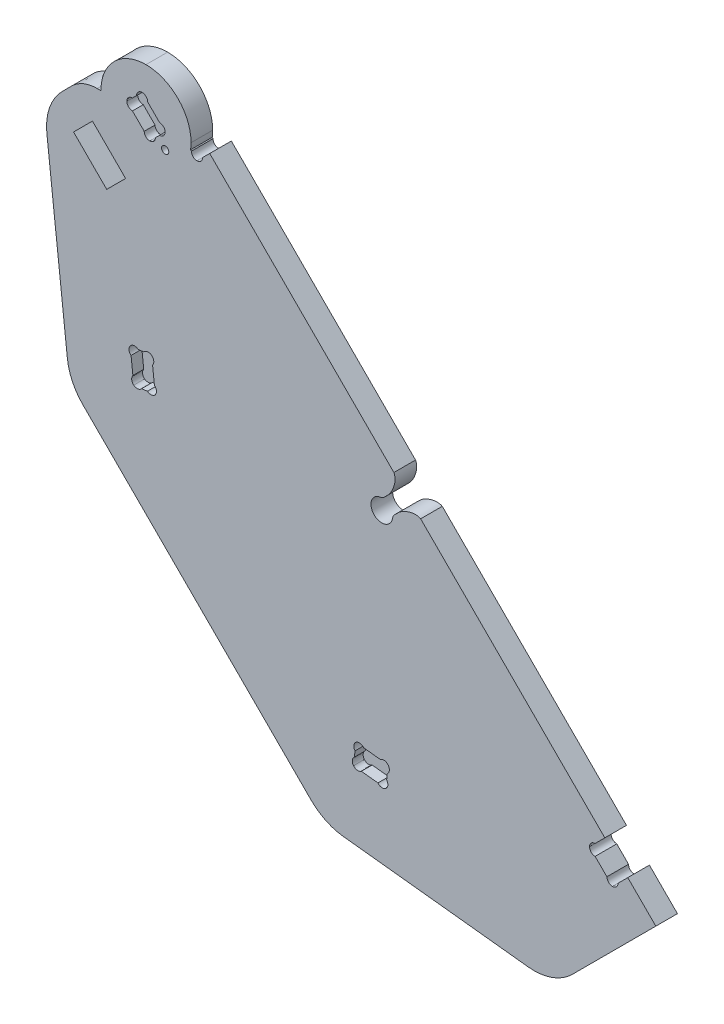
ISO-10303-21;
HEADER;
FILE_DESCRIPTION(('STEP AP214'),'2;1');
FILE_NAME('part.step','',(''),(''),'','','');
FILE_SCHEMA(('AUTOMOTIVE_DESIGN { 1 0 10303 214 1 1 1 1 }'));
ENDSEC;
DATA;
#1=APPLICATION_CONTEXT('core data for automotive mechanical design processes');
#2=APPLICATION_PROTOCOL_DEFINITION('international standard','automotive_design',2000,#1);
#3=PRODUCT_CONTEXT('',#1,'mechanical');
#4=PRODUCT('Part','Part','',(#3));
#5=PRODUCT_RELATED_PRODUCT_CATEGORY('part','',(#4));
#6=PRODUCT_DEFINITION_FORMATION('','',#4);
#7=PRODUCT_DEFINITION_CONTEXT('part definition',#1,'design');
#8=PRODUCT_DEFINITION('design','',#6,#7);
#9=PRODUCT_DEFINITION_SHAPE('','',#8);
#10=(LENGTH_UNIT() NAMED_UNIT(*) SI_UNIT(.MILLI.,.METRE.));
#11=(NAMED_UNIT(*) PLANE_ANGLE_UNIT() SI_UNIT($,.RADIAN.));
#12=(NAMED_UNIT(*) SI_UNIT($,.STERADIAN.) SOLID_ANGLE_UNIT());
#13=UNCERTAINTY_MEASURE_WITH_UNIT(LENGTH_MEASURE(1.E-05),#10,'distance_accuracy_value','');
#14=(GEOMETRIC_REPRESENTATION_CONTEXT(3) GLOBAL_UNCERTAINTY_ASSIGNED_CONTEXT((#13)) GLOBAL_UNIT_ASSIGNED_CONTEXT((#10,
#11,#12)) REPRESENTATION_CONTEXT('',''));
#15=CARTESIAN_POINT('',(0.,0.,0.));
#16=DIRECTION('',(0.,0.,1.));
#17=DIRECTION('',(1.,0.,0.));
#18=AXIS2_PLACEMENT_3D('',#15,#16,#17);
#19=CARTESIAN_POINT('',(1165.77569088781,1165.77569088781,6.));
#20=DIRECTION('',(-0.707106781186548,-0.707106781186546,0.));
#21=DIRECTION('',(0.707106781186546,-0.707106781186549,0.));
#22=AXIS2_PLACEMENT_3D('',#19,#20,#21);
#23=PLANE('',#22);
#24=DIRECTION('',(-0.707106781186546,0.707106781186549,0.));
#25=VECTOR('',#24,1.);
#26=CARTESIAN_POINT('',(1165.77569088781,1165.77569088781,6.));
#27=LINE('',#26,#25);
#28=CARTESIAN_POINT('',(2192.0487507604,139.502631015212,6.));
#29=VERTEX_POINT('',#28);
#30=CARTESIAN_POINT('',(2140.95497607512,190.596405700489,6.));
#31=VERTEX_POINT('',#30);
#32=EDGE_CURVE('E1584',#29,#31,#27,.T.);
#33=ORIENTED_EDGE('',*,*,#32,.F.);
#34=DIRECTION('',(0.,0.,1.));
#35=VECTOR('',#34,1.);
#36=CARTESIAN_POINT('',(2192.0487507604,139.502631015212,0.));
#37=LINE('',#36,#35);
#38=CARTESIAN_POINT('',(2192.0487507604,139.502631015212,0.));
#39=VERTEX_POINT('',#38);
#40=EDGE_CURVE('E1139',#39,#29,#37,.T.);
#41=ORIENTED_EDGE('',*,*,#40,.F.);
#42=DIRECTION('',(-0.707106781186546,0.707106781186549,0.));
#43=VECTOR('',#42,1.);
#44=CARTESIAN_POINT('',(1165.77569088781,1165.77569088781,0.));
#45=LINE('',#44,#43);
#46=CARTESIAN_POINT('',(2140.95497607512,190.596405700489,0.));
#47=VERTEX_POINT('',#46);
#48=EDGE_CURVE('E710',#39,#47,#45,.T.);
#49=ORIENTED_EDGE('',*,*,#48,.T.);
#50=DIRECTION('',(0.,0.,-1.));
#51=VECTOR('',#50,1.);
#52=CARTESIAN_POINT('',(2140.95497607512,190.596405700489,6.));
#53=LINE('',#52,#51);
#54=EDGE_CURVE('E826',#31,#47,#53,.T.);
#55=ORIENTED_EDGE('',*,*,#54,.F.);
#56=EDGE_LOOP('',(#33,#41,#49,#55));
#57=FACE_BOUND('',#56,.T.);
#58=ADVANCED_FACE('F39',(#57),#23,.F.);
#59=CARTESIAN_POINT('',(2129.30604658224,184.567665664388,6.));
#60=CARTESIAN_POINT('',(2128.91552229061,184.177141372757,6.));
#61=CARTESIAN_POINT('',(2128.28235731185,184.177141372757,6.));
#62=CARTESIAN_POINT('',(2127.50130872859,184.958189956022,6.));
#63=CARTESIAN_POINT('',(2127.50130872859,185.591354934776,6.));
#64=CARTESIAN_POINT('',(2127.89183302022,185.981879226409,6.));
#65=B_SPLINE_CURVE_WITH_KNOTS('',3,(#59,#60,#61,#62,#63,#64),.UNSPECIFIED.,.F.,.F.,(4,2,4),(2.,
3.,4.),.UNSPECIFIED.);
#66=DIRECTION('',(0.,0.,-1.));
#67=VECTOR('',#66,1.);
#68=SURFACE_OF_LINEAR_EXTRUSION('',#65,#67);
#69=DIRECTION('',(0.,0.,-1.));
#70=VECTOR('',#69,1.);
#71=CARTESIAN_POINT('',(2129.30604658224,184.567665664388,6.));
#72=LINE('',#71,#70);
#73=CARTESIAN_POINT('',(2129.30604658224,184.567665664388,6.));
#74=VERTEX_POINT('',#73);
#75=CARTESIAN_POINT('',(2129.30604658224,184.567665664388,0.));
#76=VERTEX_POINT('',#75);
#77=EDGE_CURVE('E49',#74,#76,#72,.T.);
#78=ORIENTED_EDGE('',*,*,#77,.T.);
#79=CARTESIAN_POINT('',(2129.30604658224,184.567665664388,0.));
#80=CARTESIAN_POINT('',(2128.91552229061,184.177141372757,0.));
#81=CARTESIAN_POINT('',(2128.28235731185,184.177141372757,0.));
#82=CARTESIAN_POINT('',(2127.50130872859,184.958189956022,0.));
#83=CARTESIAN_POINT('',(2127.50130872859,185.591354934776,0.));
#84=CARTESIAN_POINT('',(2127.89183302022,185.981879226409,0.));
#85=B_SPLINE_CURVE_WITH_KNOTS('',3,(#79,#80,#81,#82,#83,#84),.UNSPECIFIED.,.F.,.F.,(4,2,4),(2.,
3.,4.),.UNSPECIFIED.);
#86=CARTESIAN_POINT('',(2127.89183302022,185.981879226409,0.));
#87=VERTEX_POINT('',#86);
#88=EDGE_CURVE('E1151',#87,#76,#85,.F.);
#89=ORIENTED_EDGE('',*,*,#88,.F.);
#90=DIRECTION('',(0.,0.,-1.));
#91=VECTOR('',#90,1.);
#92=CARTESIAN_POINT('',(2127.89183302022,185.981879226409,6.));
#93=LINE('',#92,#91);
#94=CARTESIAN_POINT('',(2127.89183302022,185.981879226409,6.));
#95=VERTEX_POINT('',#94);
#96=EDGE_CURVE('E11',#95,#87,#93,.T.);
#97=ORIENTED_EDGE('',*,*,#96,.F.);
#98=EDGE_CURVE('E517',#74,#95,#65,.T.);
#99=ORIENTED_EDGE('',*,*,#98,.F.);
#100=EDGE_LOOP('',(#78,#89,#97,#99));
#101=FACE_BOUND('',#100,.T.);
#102=ADVANCED_FACE('F576',(#101),#68,.F.);
#103=CARTESIAN_POINT('',(963.15846990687,-963.158469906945,6.));
#104=DIRECTION('',(-0.70710678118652,0.707106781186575,0.));
#105=DIRECTION('',(-0.707106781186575,-0.70710678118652,0.));
#106=AXIS2_PLACEMENT_3D('',#103,#104,#105);
#107=PLANE('',#106);
#108=DIRECTION('',(0.707106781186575,0.70710678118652,0.));
#109=VECTOR('',#108,1.);
#110=CARTESIAN_POINT('',(963.15846990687,-963.158469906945,6.));
#111=LINE('',#110,#109);
#112=CARTESIAN_POINT('',(2103.19357323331,176.876633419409,6.));
#113=VERTEX_POINT('',#112);
#114=CARTESIAN_POINT('',(2108.43402015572,182.11708034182,6.));
#115=VERTEX_POINT('',#114);
#116=EDGE_CURVE('E498',#113,#115,#111,.T.);
#117=ORIENTED_EDGE('',*,*,#116,.F.);
#118=DIRECTION('',(0.,0.,1.));
#119=VECTOR('',#118,1.);
#120=CARTESIAN_POINT('',(2103.19357323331,176.876633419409,-28.4111111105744));
#121=LINE('',#120,#119);
#122=CARTESIAN_POINT('',(2103.1935732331,176.876633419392,0.));
#123=VERTEX_POINT('',#122);
#124=EDGE_CURVE('E502',#123,#113,#121,.T.);
#125=ORIENTED_EDGE('',*,*,#124,.F.);
#126=DIRECTION('',(-0.707106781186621,-0.707106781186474,0.));
#127=VECTOR('',#126,1.);
#128=CARTESIAN_POINT('',(963.158469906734,-963.158469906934,0.));
#129=LINE('',#128,#127);
#130=CARTESIAN_POINT('',(2108.43402015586,182.117080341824,0.));
#131=VERTEX_POINT('',#130);
#132=EDGE_CURVE('E1138',#131,#123,#129,.T.);
#133=ORIENTED_EDGE('',*,*,#132,.F.);
#134=DIRECTION('',(0.,0.,1.));
#135=VECTOR('',#134,1.);
#136=CARTESIAN_POINT('',(2108.43402015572,182.11708034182,-28.4111111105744));
#137=LINE('',#136,#135);
#138=EDGE_CURVE('E503',#131,#115,#137,.T.);
#139=ORIENTED_EDGE('',*,*,#138,.T.);
#140=EDGE_LOOP('',(#117,#125,#133,#139));
#141=FACE_BOUND('',#140,.T.);
#142=ADVANCED_FACE('F500',(#141),#107,.F.);
#143=CARTESIAN_POINT('',(1145.27555024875,1145.27555024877,6.));
#144=DIRECTION('',(0.707106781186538,0.707106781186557,0.));
#145=DIRECTION('',(-0.707106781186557,0.707106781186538,0.));
#146=AXIS2_PLACEMENT_3D('',#143,#144,#145);
#147=PLANE('',#146);
#148=DIRECTION('',(0.707106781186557,-0.707106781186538,0.));
#149=VECTOR('',#148,1.);
#150=CARTESIAN_POINT('',(1145.27555024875,1145.27555024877,6.));
#151=LINE('',#150,#149);
#152=CARTESIAN_POINT('',(2117.62640831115,172.924692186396,6.));
#153=VERTEX_POINT('',#152);
#154=EDGE_CURVE('E506',#115,#153,#151,.T.);
#155=ORIENTED_EDGE('',*,*,#154,.F.);
#156=ORIENTED_EDGE('',*,*,#138,.F.);
#157=DIRECTION('',(-0.707106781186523,0.707106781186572,0.));
#158=VECTOR('',#157,1.);
#159=CARTESIAN_POINT('',(1145.27555024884,1145.27555024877,0.));
#160=LINE('',#159,#158);
#161=CARTESIAN_POINT('',(2117.62640831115,172.924692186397,0.));
#162=VERTEX_POINT('',#161);
#163=EDGE_CURVE('E57',#162,#131,#160,.T.);
#164=ORIENTED_EDGE('',*,*,#163,.F.);
#165=DIRECTION('',(0.,0.,1.));
#166=VECTOR('',#165,1.);
#167=CARTESIAN_POINT('',(2117.62640831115,172.924692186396,0.));
#168=LINE('',#167,#166);
#169=EDGE_CURVE('E530',#162,#153,#168,.T.);
#170=ORIENTED_EDGE('',*,*,#169,.T.);
#171=EDGE_LOOP('',(#155,#156,#164,#170));
#172=FACE_BOUND('',#171,.T.);
#173=ADVANCED_FACE('F1406',(#172),#147,.F.);
#174=CARTESIAN_POINT('',(2183.02247796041,63.226771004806,6.));
#175=CARTESIAN_POINT('',(2182.35402196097,62.6920062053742,6.));
#176=CARTESIAN_POINT('',(2181.37861878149,62.8003843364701,6.));
#177=CARTESIAN_POINT('',(2180.84385398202,63.4688403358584,6.));
#178=B_SPLINE_CURVE_WITH_KNOTS('',3,(#174,#175,#176,#177),.UNSPECIFIED.,.F.,.F.,(4,4),(9.,10.),.UNSPECIFIED.);
#179=DIRECTION('',(0.,0.,-1.));
#180=VECTOR('',#179,1.);
#181=SURFACE_OF_LINEAR_EXTRUSION('',#178,#180);
#182=CARTESIAN_POINT('',(2183.02247796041,63.226771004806,3.));
#183=CARTESIAN_POINT('',(2182.35402196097,62.6920062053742,3.));
#184=CARTESIAN_POINT('',(2181.37861878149,62.8003843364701,3.));
#185=CARTESIAN_POINT('',(2180.84385398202,63.4688403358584,3.));
#186=B_SPLINE_CURVE_WITH_KNOTS('',3,(#182,#183,#184,#185),.UNSPECIFIED.,.F.,.F.,(4,4),(9.,10.),.UNSPECIFIED.);
#187=CARTESIAN_POINT('',(2180.84385398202,63.4688403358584,3.));
#188=VERTEX_POINT('',#187);
#189=CARTESIAN_POINT('',(2183.02247796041,63.226771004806,3.));
#190=VERTEX_POINT('',#189);
#191=EDGE_CURVE('E597',#188,#190,#186,.F.);
#192=ORIENTED_EDGE('',*,*,#191,.F.);
#193=DIRECTION('',(0.,0.,-1.));
#194=VECTOR('',#193,1.);
#195=CARTESIAN_POINT('',(2180.84385398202,63.4688403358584,6.));
#196=LINE('',#195,#194);
#197=CARTESIAN_POINT('',(2180.84385398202,63.4688403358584,6.));
#198=VERTEX_POINT('',#197);
#199=EDGE_CURVE('E745',#198,#188,#196,.T.);
#200=ORIENTED_EDGE('',*,*,#199,.F.);
#201=CARTESIAN_POINT('',(2183.02247796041,63.226771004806,6.));
#202=VERTEX_POINT('',#201);
#203=EDGE_CURVE('E1383',#202,#198,#178,.T.);
#204=ORIENTED_EDGE('',*,*,#203,.F.);
#205=DIRECTION('',(0.,0.,-1.));
#206=VECTOR('',#205,1.);
#207=CARTESIAN_POINT('',(2183.02247796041,63.226771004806,6.));
#208=LINE('',#207,#206);
#209=EDGE_CURVE('E747',#202,#190,#208,.T.);
#210=ORIENTED_EDGE('',*,*,#209,.T.);
#211=EDGE_LOOP('',(#192,#200,#204,#210));
#212=FACE_BOUND('',#211,.T.);
#213=ADVANCED_FACE('F1372',(#212),#181,.F.);
#214=CARTESIAN_POINT('',(2180.84385398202,63.4688403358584,6.));
#215=CARTESIAN_POINT('',(2180.30908918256,64.1372963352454,6.));
#216=CARTESIAN_POINT('',(2180.41746731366,65.1126995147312,6.));
#217=CARTESIAN_POINT('',(2181.08592331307,65.6474643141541,6.));
#218=B_SPLINE_CURVE_WITH_KNOTS('',3,(#214,#215,#216,#217),.UNSPECIFIED.,.F.,.F.,(4,4),(10.,11.),.UNSPECIFIED.);
#219=DIRECTION('',(0.,0.,-1.));
#220=VECTOR('',#219,1.);
#221=SURFACE_OF_LINEAR_EXTRUSION('',#218,#220);
#222=CARTESIAN_POINT('',(2180.84385398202,63.4688403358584,3.));
#223=CARTESIAN_POINT('',(2180.30908918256,64.1372963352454,3.));
#224=CARTESIAN_POINT('',(2180.41746731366,65.1126995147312,3.));
#225=CARTESIAN_POINT('',(2181.08592331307,65.6474643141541,3.));
#226=B_SPLINE_CURVE_WITH_KNOTS('',3,(#222,#223,#224,#225),.UNSPECIFIED.,.F.,.F.,(4,4),(10.,11.),.UNSPECIFIED.);
#227=CARTESIAN_POINT('',(2181.08592331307,65.6474643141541,3.));
#228=VERTEX_POINT('',#227);
#229=EDGE_CURVE('E1362',#228,#188,#226,.F.);
#230=ORIENTED_EDGE('',*,*,#229,.F.);
#231=DIRECTION('',(0.,0.,-1.));
#232=VECTOR('',#231,1.);
#233=CARTESIAN_POINT('',(2181.08592331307,65.6474643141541,6.));
#234=LINE('',#233,#232);
#235=CARTESIAN_POINT('',(2181.08592331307,65.6474643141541,6.));
#236=VERTEX_POINT('',#235);
#237=EDGE_CURVE('E777',#236,#228,#234,.T.);
#238=ORIENTED_EDGE('',*,*,#237,.F.);
#239=EDGE_CURVE('E1378',#198,#236,#218,.T.);
#240=ORIENTED_EDGE('',*,*,#239,.F.);
#241=ORIENTED_EDGE('',*,*,#199,.T.);
#242=EDGE_LOOP('',(#230,#238,#240,#241));
#243=FACE_BOUND('',#242,.T.);
#244=ADVANCED_FACE('F1376',(#243),#221,.F.);
#245=CARTESIAN_POINT('',(2147.28210497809,-238.586900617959,6.));
#246=DIRECTION('',(-0.993883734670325,0.110431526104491,0.));
#247=DIRECTION('',(-0.110431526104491,-0.993883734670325,0.));
#248=AXIS2_PLACEMENT_3D('',#245,#246,#247);
#249=PLANE('',#248);
#250=DIRECTION('',(-0.110431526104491,-0.993883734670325,0.));
#251=VECTOR('',#250,1.);
#252=CARTESIAN_POINT('',(2147.28210497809,-238.586900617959,3.));
#253=LINE('',#252,#251);
#254=CARTESIAN_POINT('',(2181.26437380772,67.25351876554,3.));
#255=VERTEX_POINT('',#254);
#256=EDGE_CURVE('E1357',#255,#228,#253,.T.);
#257=ORIENTED_EDGE('',*,*,#256,.F.);
#258=DIRECTION('',(0.,0.,-1.));
#259=VECTOR('',#258,1.);
#260=CARTESIAN_POINT('',(2181.26437380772,67.25351876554,6.));
#261=LINE('',#260,#259);
#262=CARTESIAN_POINT('',(2181.26437380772,67.25351876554,6.));
#263=VERTEX_POINT('',#262);
#264=EDGE_CURVE('E774',#263,#255,#261,.T.);
#265=ORIENTED_EDGE('',*,*,#264,.F.);
#266=DIRECTION('',(0.110431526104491,0.993883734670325,0.));
#267=VECTOR('',#266,1.);
#268=CARTESIAN_POINT('',(2147.28210497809,-238.586900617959,6.));
#269=LINE('',#268,#267);
#270=EDGE_CURVE('E1382',#236,#263,#269,.T.);
#271=ORIENTED_EDGE('',*,*,#270,.F.);
#272=ORIENTED_EDGE('',*,*,#237,.T.);
#273=EDGE_LOOP('',(#257,#265,#271,#272));
#274=FACE_BOUND('',#273,.T.);
#275=ADVANCED_FACE('F1979',(#274),#249,.F.);
#276=CARTESIAN_POINT('',(2181.26437380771,67.25351876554,6.));
#277=CARTESIAN_POINT('',(2180.72960900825,67.921974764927,6.));
#278=CARTESIAN_POINT('',(2180.83798713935,68.8973779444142,6.));
#279=CARTESIAN_POINT('',(2181.50644313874,69.4321427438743,6.));
#280=B_SPLINE_CURVE_WITH_KNOTS('',3,(#276,#277,#278,#279),.UNSPECIFIED.,.F.,.F.,(4,4),(0.,1.),.UNSPECIFIED.);
#281=DIRECTION('',(0.,0.,-1.));
#282=VECTOR('',#281,1.);
#283=SURFACE_OF_LINEAR_EXTRUSION('',#280,#282);
#284=CARTESIAN_POINT('',(2181.26437380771,67.25351876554,3.));
#285=CARTESIAN_POINT('',(2180.72960900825,67.921974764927,3.));
#286=CARTESIAN_POINT('',(2180.83798713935,68.8973779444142,3.));
#287=CARTESIAN_POINT('',(2181.50644313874,69.4321427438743,3.));
#288=B_SPLINE_CURVE_WITH_KNOTS('',3,(#284,#285,#286,#287),.UNSPECIFIED.,.F.,.F.,(4,4),(0.,1.),.UNSPECIFIED.);
#289=CARTESIAN_POINT('',(2181.50644313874,69.4321427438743,3.));
#290=VERTEX_POINT('',#289);
#291=EDGE_CURVE('E1349',#290,#255,#288,.F.);
#292=ORIENTED_EDGE('',*,*,#291,.F.);
#293=DIRECTION('',(0.,0.,-1.));
#294=VECTOR('',#293,1.);
#295=CARTESIAN_POINT('',(2181.50644313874,69.4321427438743,6.));
#296=LINE('',#295,#294);
#297=CARTESIAN_POINT('',(2181.50644313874,69.4321427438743,6.));
#298=VERTEX_POINT('',#297);
#299=EDGE_CURVE('E771',#298,#290,#296,.T.);
#300=ORIENTED_EDGE('',*,*,#299,.F.);
#301=EDGE_CURVE('E2396',#263,#298,#280,.T.);
#302=ORIENTED_EDGE('',*,*,#301,.F.);
#303=ORIENTED_EDGE('',*,*,#264,.T.);
#304=EDGE_LOOP('',(#292,#300,#302,#303));
#305=FACE_BOUND('',#304,.T.);
#306=ADVANCED_FACE('F1969',(#305),#283,.F.);
#307=CARTESIAN_POINT('',(2181.50644313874,69.4321427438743,6.));
#308=CARTESIAN_POINT('',(2182.17489913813,69.9669075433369,6.));
#309=CARTESIAN_POINT('',(2183.15030231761,69.8585294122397,6.));
#310=CARTESIAN_POINT('',(2183.68506711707,69.1900734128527,6.));
#311=B_SPLINE_CURVE_WITH_KNOTS('',3,(#307,#308,#309,#310),.UNSPECIFIED.,.F.,.F.,(4,4),(1.,2.),.UNSPECIFIED.);
#312=DIRECTION('',(0.,0.,-1.));
#313=VECTOR('',#312,1.);
#314=SURFACE_OF_LINEAR_EXTRUSION('',#311,#313);
#315=CARTESIAN_POINT('',(2181.50644313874,69.4321427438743,3.));
#316=CARTESIAN_POINT('',(2182.17489913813,69.9669075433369,3.));
#317=CARTESIAN_POINT('',(2183.15030231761,69.8585294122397,3.));
#318=CARTESIAN_POINT('',(2183.68506711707,69.1900734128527,3.));
#319=B_SPLINE_CURVE_WITH_KNOTS('',3,(#315,#316,#317,#318),.UNSPECIFIED.,.F.,.F.,(4,4),(1.,2.),.UNSPECIFIED.);
#320=CARTESIAN_POINT('',(2183.68506711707,69.1900734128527,3.));
#321=VERTEX_POINT('',#320);
#322=EDGE_CURVE('E1344',#321,#290,#319,.F.);
#323=ORIENTED_EDGE('',*,*,#322,.F.);
#324=DIRECTION('',(0.,0.,-1.));
#325=VECTOR('',#324,1.);
#326=CARTESIAN_POINT('',(2183.68506711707,69.1900734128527,6.));
#327=LINE('',#326,#325);
#328=CARTESIAN_POINT('',(2183.68506711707,69.1900734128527,6.));
#329=VERTEX_POINT('',#328);
#330=EDGE_CURVE('E768',#329,#321,#327,.T.);
#331=ORIENTED_EDGE('',*,*,#330,.F.);
#332=EDGE_CURVE('E2391',#298,#329,#311,.T.);
#333=ORIENTED_EDGE('',*,*,#332,.F.);
#334=ORIENTED_EDGE('',*,*,#299,.T.);
#335=EDGE_LOOP('',(#323,#331,#333,#334));
#336=FACE_BOUND('',#335,.T.);
#337=ADVANCED_FACE('F1959',(#336),#314,.F.);
#338=CARTESIAN_POINT('',(34.2243381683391,308.019043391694,6.));
#339=DIRECTION('',(0.110431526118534,0.993883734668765,0.));
#340=DIRECTION('',(-0.993883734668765,0.110431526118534,0.));
#341=AXIS2_PLACEMENT_3D('',#338,#339,#340);
#342=PLANE('',#341);
#343=DIRECTION('',(-0.993883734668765,0.110431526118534,0.));
#344=VECTOR('',#343,1.);
#345=CARTESIAN_POINT('',(34.2243381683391,308.019043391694,3.));
#346=LINE('',#345,#344);
#347=CARTESIAN_POINT('',(2188.27277277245,68.6803283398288,3.));
#348=VERTEX_POINT('',#347);
#349=EDGE_CURVE('E1338',#348,#321,#346,.T.);
#350=ORIENTED_EDGE('',*,*,#349,.F.);
#351=DIRECTION('',(0.,0.,-1.));
#352=VECTOR('',#351,1.);
#353=CARTESIAN_POINT('',(2188.27277277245,68.6803283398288,6.));
#354=LINE('',#353,#352);
#355=CARTESIAN_POINT('',(2188.27277277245,68.6803283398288,6.));
#356=VERTEX_POINT('',#355);
#357=EDGE_CURVE('E765',#356,#348,#354,.T.);
#358=ORIENTED_EDGE('',*,*,#357,.F.);
#359=DIRECTION('',(0.993883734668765,-0.110431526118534,0.));
#360=VECTOR('',#359,1.);
#361=CARTESIAN_POINT('',(34.2243381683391,308.019043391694,6.));
#362=LINE('',#361,#360);
#363=EDGE_CURVE('E2395',#329,#356,#362,.T.);
#364=ORIENTED_EDGE('',*,*,#363,.F.);
#365=ORIENTED_EDGE('',*,*,#330,.T.);
#366=EDGE_LOOP('',(#350,#358,#364,#365));
#367=FACE_BOUND('',#366,.T.);
#368=ADVANCED_FACE('F1949',(#367),#342,.F.);
#369=CARTESIAN_POINT('',(2188.27277277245,68.6803283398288,6.));
#370=CARTESIAN_POINT('',(2188.94122877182,69.2150931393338,6.));
#371=CARTESIAN_POINT('',(2189.91663195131,69.1067150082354,6.));
#372=CARTESIAN_POINT('',(2190.45139675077,68.4382590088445,6.));
#373=B_SPLINE_CURVE_WITH_KNOTS('',3,(#369,#370,#371,#372),.UNSPECIFIED.,.F.,.F.,(4,4),(3.,4.),.UNSPECIFIED.);
#374=DIRECTION('',(0.,0.,-1.));
#375=VECTOR('',#374,1.);
#376=SURFACE_OF_LINEAR_EXTRUSION('',#373,#375);
#377=CARTESIAN_POINT('',(2188.27277277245,68.6803283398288,3.));
#378=CARTESIAN_POINT('',(2188.94122877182,69.2150931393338,3.));
#379=CARTESIAN_POINT('',(2189.91663195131,69.1067150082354,3.));
#380=CARTESIAN_POINT('',(2190.45139675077,68.4382590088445,3.));
#381=B_SPLINE_CURVE_WITH_KNOTS('',3,(#377,#378,#379,#380),.UNSPECIFIED.,.F.,.F.,(4,4),(3.,4.),.UNSPECIFIED.);
#382=CARTESIAN_POINT('',(2190.45139675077,68.4382590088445,3.));
#383=VERTEX_POINT('',#382);
#384=EDGE_CURVE('E1330',#383,#348,#381,.F.);
#385=ORIENTED_EDGE('',*,*,#384,.F.);
#386=DIRECTION('',(0.,0.,-1.));
#387=VECTOR('',#386,1.);
#388=CARTESIAN_POINT('',(2190.45139675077,68.4382590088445,6.));
#389=LINE('',#388,#387);
#390=CARTESIAN_POINT('',(2190.45139675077,68.4382590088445,6.));
#391=VERTEX_POINT('',#390);
#392=EDGE_CURVE('E762',#391,#383,#389,.T.);
#393=ORIENTED_EDGE('',*,*,#392,.F.);
#394=EDGE_CURVE('E2381',#356,#391,#373,.T.);
#395=ORIENTED_EDGE('',*,*,#394,.F.);
#396=ORIENTED_EDGE('',*,*,#357,.T.);
#397=EDGE_LOOP('',(#385,#393,#395,#396));
#398=FACE_BOUND('',#397,.T.);
#399=ADVANCED_FACE('F1939',(#398),#376,.F.);
#400=CARTESIAN_POINT('',(2190.45139675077,68.4382590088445,6.));
#401=CARTESIAN_POINT('',(2190.98616155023,67.7698030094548,6.));
#402=CARTESIAN_POINT('',(2190.87778341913,66.7943998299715,6.));
#403=CARTESIAN_POINT('',(2190.20932741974,66.2596350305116,6.));
#404=B_SPLINE_CURVE_WITH_KNOTS('',3,(#400,#401,#402,#403),.UNSPECIFIED.,.F.,.F.,(4,4),(4.,5.),.UNSPECIFIED.);
#405=DIRECTION('',(0.,0.,-1.));
#406=VECTOR('',#405,1.);
#407=SURFACE_OF_LINEAR_EXTRUSION('',#404,#406);
#408=CARTESIAN_POINT('',(2190.45139675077,68.4382590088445,3.));
#409=CARTESIAN_POINT('',(2190.98616155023,67.7698030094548,3.));
#410=CARTESIAN_POINT('',(2190.87778341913,66.7943998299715,3.));
#411=CARTESIAN_POINT('',(2190.20932741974,66.2596350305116,3.));
#412=B_SPLINE_CURVE_WITH_KNOTS('',3,(#408,#409,#410,#411),.UNSPECIFIED.,.F.,.F.,(4,4),(4.,5.),.UNSPECIFIED.);
#413=CARTESIAN_POINT('',(2190.20932741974,66.2596350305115,3.));
#414=VERTEX_POINT('',#413);
#415=EDGE_CURVE('E1325',#414,#383,#412,.F.);
#416=ORIENTED_EDGE('',*,*,#415,.F.);
#417=DIRECTION('',(0.,0.,-1.));
#418=VECTOR('',#417,1.);
#419=CARTESIAN_POINT('',(2190.20932741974,66.2596350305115,6.));
#420=LINE('',#419,#418);
#421=CARTESIAN_POINT('',(2190.20932741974,66.2596350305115,6.));
#422=VERTEX_POINT('',#421);
#423=EDGE_CURVE('E759',#422,#414,#420,.T.);
#424=ORIENTED_EDGE('',*,*,#423,.F.);
#425=EDGE_CURVE('E2376',#391,#422,#404,.T.);
#426=ORIENTED_EDGE('',*,*,#425,.F.);
#427=ORIENTED_EDGE('',*,*,#392,.T.);
#428=EDGE_LOOP('',(#416,#424,#426,#427));
#429=FACE_BOUND('',#428,.T.);
#430=ADVANCED_FACE('F1929',(#429),#407,.F.);
#431=CARTESIAN_POINT('',(2156.22705859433,-239.580784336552,6.));
#432=DIRECTION('',(0.993883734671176,-0.110431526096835,0.));
#433=DIRECTION('',(0.110431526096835,0.993883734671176,0.));
#434=AXIS2_PLACEMENT_3D('',#431,#432,#433);
#435=PLANE('',#434);
#436=DIRECTION('',(0.110431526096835,0.993883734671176,0.));
#437=VECTOR('',#436,1.);
#438=CARTESIAN_POINT('',(2156.22705859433,-239.580784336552,3.));
#439=LINE('',#438,#437);
#440=CARTESIAN_POINT('',(2190.0308769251,64.6535805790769,3.));
#441=VERTEX_POINT('',#440);
#442=EDGE_CURVE('E1319',#441,#414,#439,.T.);
#443=ORIENTED_EDGE('',*,*,#442,.F.);
#444=DIRECTION('',(0.,0.,-1.));
#445=VECTOR('',#444,1.);
#446=CARTESIAN_POINT('',(2190.0308769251,64.6535805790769,6.));
#447=LINE('',#446,#445);
#448=CARTESIAN_POINT('',(2190.0308769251,64.6535805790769,6.));
#449=VERTEX_POINT('',#448);
#450=EDGE_CURVE('E756',#449,#441,#447,.T.);
#451=ORIENTED_EDGE('',*,*,#450,.F.);
#452=DIRECTION('',(-0.110431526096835,-0.993883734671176,0.));
#453=VECTOR('',#452,1.);
#454=CARTESIAN_POINT('',(2156.22705859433,-239.580784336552,6.));
#455=LINE('',#454,#453);
#456=EDGE_CURVE('E2371',#422,#449,#455,.T.);
#457=ORIENTED_EDGE('',*,*,#456,.F.);
#458=ORIENTED_EDGE('',*,*,#423,.T.);
#459=EDGE_LOOP('',(#443,#451,#457,#458));
#460=FACE_BOUND('',#459,.T.);
#461=ADVANCED_FACE('F1919',(#460),#435,.F.);
#462=CARTESIAN_POINT('',(2190.0308769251,64.6535805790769,6.));
#463=CARTESIAN_POINT('',(2190.56564172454,63.9851245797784,6.));
#464=CARTESIAN_POINT('',(2190.45726359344,63.0097214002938,6.));
#465=CARTESIAN_POINT('',(2189.78880759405,62.4749566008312,6.));
#466=B_SPLINE_CURVE_WITH_KNOTS('',3,(#462,#463,#464,#465),.UNSPECIFIED.,.F.,.F.,(4,4),(6.,7.),.UNSPECIFIED.);
#467=DIRECTION('',(0.,0.,-1.));
#468=VECTOR('',#467,1.);
#469=SURFACE_OF_LINEAR_EXTRUSION('',#466,#468);
#470=CARTESIAN_POINT('',(2190.0308769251,64.6535805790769,3.));
#471=CARTESIAN_POINT('',(2190.56564172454,63.9851245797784,3.));
#472=CARTESIAN_POINT('',(2190.45726359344,63.0097214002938,3.));
#473=CARTESIAN_POINT('',(2189.78880759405,62.4749566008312,3.));
#474=B_SPLINE_CURVE_WITH_KNOTS('',3,(#470,#471,#472,#473),.UNSPECIFIED.,.F.,.F.,(4,4),(6.,7.),.UNSPECIFIED.);
#475=CARTESIAN_POINT('',(2189.78880759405,62.4749566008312,3.));
#476=VERTEX_POINT('',#475);
#477=EDGE_CURVE('E1311',#476,#441,#474,.F.);
#478=ORIENTED_EDGE('',*,*,#477,.F.);
#479=DIRECTION('',(0.,0.,-1.));
#480=VECTOR('',#479,1.);
#481=CARTESIAN_POINT('',(2189.78880759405,62.4749566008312,6.));
#482=LINE('',#481,#480);
#483=CARTESIAN_POINT('',(2189.78880759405,62.4749566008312,6.));
#484=VERTEX_POINT('',#483);
#485=EDGE_CURVE('E753',#484,#476,#482,.T.);
#486=ORIENTED_EDGE('',*,*,#485,.F.);
#487=EDGE_CURVE('E2362',#449,#484,#466,.T.);
#488=ORIENTED_EDGE('',*,*,#487,.F.);
#489=ORIENTED_EDGE('',*,*,#450,.T.);
#490=EDGE_LOOP('',(#478,#486,#488,#489));
#491=FACE_BOUND('',#490,.T.);
#492=ADVANCED_FACE('F1909',(#491),#469,.F.);
#493=CARTESIAN_POINT('',(2189.78880759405,62.4749566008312,6.));
#494=CARTESIAN_POINT('',(2189.12035159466,61.9401918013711,6.));
#495=CARTESIAN_POINT('',(2188.14494841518,62.0485699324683,6.));
#496=CARTESIAN_POINT('',(2187.61018361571,62.7170259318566,6.));
#497=B_SPLINE_CURVE_WITH_KNOTS('',3,(#493,#494,#495,#496),.UNSPECIFIED.,.F.,.F.,(4,4),(7.,8.),.UNSPECIFIED.);
#498=DIRECTION('',(0.,0.,-1.));
#499=VECTOR('',#498,1.);
#500=SURFACE_OF_LINEAR_EXTRUSION('',#497,#499);
#501=CARTESIAN_POINT('',(2189.78880759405,62.4749566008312,3.));
#502=CARTESIAN_POINT('',(2189.12035159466,61.9401918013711,3.));
#503=CARTESIAN_POINT('',(2188.14494841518,62.0485699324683,3.));
#504=CARTESIAN_POINT('',(2187.61018361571,62.7170259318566,3.));
#505=B_SPLINE_CURVE_WITH_KNOTS('',3,(#501,#502,#503,#504),.UNSPECIFIED.,.F.,.F.,(4,4),(7.,8.),.UNSPECIFIED.);
#506=CARTESIAN_POINT('',(2187.61018361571,62.7170259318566,3.));
#507=VERTEX_POINT('',#506);
#508=EDGE_CURVE('E1306',#507,#476,#505,.F.);
#509=ORIENTED_EDGE('',*,*,#508,.F.);
#510=DIRECTION('',(0.,0.,-1.));
#511=VECTOR('',#510,1.);
#512=CARTESIAN_POINT('',(2187.61018361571,62.7170259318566,6.));
#513=LINE('',#512,#511);
#514=CARTESIAN_POINT('',(2187.61018361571,62.7170259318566,6.));
#515=VERTEX_POINT('',#514);
#516=EDGE_CURVE('E750',#515,#507,#513,.T.);
#517=ORIENTED_EDGE('',*,*,#516,.F.);
#518=EDGE_CURVE('E2357',#484,#515,#497,.T.);
#519=ORIENTED_EDGE('',*,*,#518,.F.);
#520=ORIENTED_EDGE('',*,*,#485,.T.);
#521=EDGE_LOOP('',(#509,#517,#519,#520));
#522=FACE_BOUND('',#521,.T.);
#523=ADVANCED_FACE('F1537',(#522),#500,.F.);
#524=CARTESIAN_POINT('',(2122.07205186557,124.661335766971,6.));
#525=CARTESIAN_POINT('',(2121.53728706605,123.992879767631,6.));
#526=CARTESIAN_POINT('',(2120.56188388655,123.884501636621,6.));
#527=CARTESIAN_POINT('',(2119.89342788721,124.419266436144,6.));
#528=B_SPLINE_CURVE_WITH_KNOTS('',3,(#524,#525,#526,#527),.UNSPECIFIED.,.F.,.F.,(4,4),(10.,11.),.UNSPECIFIED.);
#529=DIRECTION('',(0.,0.,-1.));
#530=VECTOR('',#529,1.);
#531=SURFACE_OF_LINEAR_EXTRUSION('',#528,#530);
#532=CARTESIAN_POINT('',(2122.07205186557,124.661335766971,3.));
#533=CARTESIAN_POINT('',(2121.53728706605,123.992879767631,3.));
#534=CARTESIAN_POINT('',(2120.56188388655,123.884501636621,3.));
#535=CARTESIAN_POINT('',(2119.89342788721,124.419266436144,3.));
#536=B_SPLINE_CURVE_WITH_KNOTS('',3,(#532,#533,#534,#535),.UNSPECIFIED.,.F.,.F.,(4,4),(10.,11.),.UNSPECIFIED.);
#537=CARTESIAN_POINT('',(2119.89342788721,124.419266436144,3.));
#538=VERTEX_POINT('',#537);
#539=CARTESIAN_POINT('',(2122.07205186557,124.661335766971,3.));
#540=VERTEX_POINT('',#539);
#541=EDGE_CURVE('E1292',#538,#540,#536,.F.);
#542=ORIENTED_EDGE('',*,*,#541,.F.);
#543=DIRECTION('',(0.,0.,-1.));
#544=VECTOR('',#543,1.);
#545=CARTESIAN_POINT('',(2119.89342788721,124.419266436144,6.));
#546=LINE('',#545,#544);
#547=CARTESIAN_POINT('',(2119.89342788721,124.419266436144,6.));
#548=VERTEX_POINT('',#547);
#549=EDGE_CURVE('E751',#548,#538,#546,.T.);
#550=ORIENTED_EDGE('',*,*,#549,.F.);
#551=CARTESIAN_POINT('',(2122.07205186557,124.661335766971,6.));
#552=VERTEX_POINT('',#551);
#553=EDGE_CURVE('E1502',#552,#548,#528,.T.);
#554=ORIENTED_EDGE('',*,*,#553,.F.);
#555=DIRECTION('',(0.,0.,-1.));
#556=VECTOR('',#555,1.);
#557=CARTESIAN_POINT('',(2122.07205186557,124.661335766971,6.));
#558=LINE('',#557,#556);
#559=EDGE_CURVE('E782',#552,#540,#558,.T.);
#560=ORIENTED_EDGE('',*,*,#559,.T.);
#561=EDGE_LOOP('',(#542,#550,#554,#560));
#562=FACE_BOUND('',#561,.T.);
#563=ADVANCED_FACE('F1508',(#562),#531,.F.);
#564=CARTESIAN_POINT('',(2119.89342788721,124.419266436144,6.));
#565=CARTESIAN_POINT('',(2119.22497188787,124.954031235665,6.));
#566=CARTESIAN_POINT('',(2119.11659375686,125.92943441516,6.));
#567=CARTESIAN_POINT('',(2119.65135855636,126.597890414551,6.));
#568=B_SPLINE_CURVE_WITH_KNOTS('',3,(#564,#565,#566,#567),.UNSPECIFIED.,.F.,.F.,(4,4),(11.,12.),.UNSPECIFIED.);
#569=DIRECTION('',(0.,0.,-1.));
#570=VECTOR('',#569,1.);
#571=SURFACE_OF_LINEAR_EXTRUSION('',#568,#570);
#572=CARTESIAN_POINT('',(2119.89342788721,124.419266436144,3.));
#573=CARTESIAN_POINT('',(2119.22497188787,124.954031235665,3.));
#574=CARTESIAN_POINT('',(2119.11659375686,125.92943441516,3.));
#575=CARTESIAN_POINT('',(2119.65135855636,126.597890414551,3.));
#576=B_SPLINE_CURVE_WITH_KNOTS('',3,(#572,#573,#574,#575),.UNSPECIFIED.,.F.,.F.,(4,4),(11.,12.),.UNSPECIFIED.);
#577=CARTESIAN_POINT('',(2119.65135855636,126.597890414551,3.));
#578=VERTEX_POINT('',#577);
#579=EDGE_CURVE('E1287',#578,#538,#576,.F.);
#580=ORIENTED_EDGE('',*,*,#579,.F.);
#581=DIRECTION('',(0.,0.,-1.));
#582=VECTOR('',#581,1.);
#583=CARTESIAN_POINT('',(2119.65135855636,126.597890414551,6.));
#584=LINE('',#583,#582);
#585=CARTESIAN_POINT('',(2119.65135855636,126.597890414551,6.));
#586=VERTEX_POINT('',#585);
#587=EDGE_CURVE('E812',#586,#578,#584,.T.);
#588=ORIENTED_EDGE('',*,*,#587,.F.);
#589=EDGE_CURVE('E1504',#548,#586,#568,.T.);
#590=ORIENTED_EDGE('',*,*,#589,.F.);
#591=ORIENTED_EDGE('',*,*,#549,.T.);
#592=EDGE_LOOP('',(#580,#588,#590,#591));
#593=FACE_BOUND('',#592,.T.);
#594=ADVANCED_FACE('F1510',(#593),#571,.F.);
#595=CARTESIAN_POINT('',(2107.69684217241,234.188537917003,6.));
#596=DIRECTION('',(-0.993883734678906,-0.110431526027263,0.));
#597=DIRECTION('',(0.110431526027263,-0.993883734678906,0.));
#598=AXIS2_PLACEMENT_3D('',#595,#596,#597);
#599=PLANE('',#598);
#600=DIRECTION('',(0.110431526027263,-0.993883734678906,0.));
#601=VECTOR('',#600,1.);
#602=CARTESIAN_POINT('',(2107.69684217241,234.188537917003,3.));
#603=LINE('',#602,#601);
#604=CARTESIAN_POINT('',(2119.14161348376,131.185596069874,3.));
#605=VERTEX_POINT('',#604);
#606=EDGE_CURVE('E1281',#605,#578,#603,.T.);
#607=ORIENTED_EDGE('',*,*,#606,.F.);
#608=DIRECTION('',(0.,0.,-1.));
#609=VECTOR('',#608,1.);
#610=CARTESIAN_POINT('',(2119.14161348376,131.185596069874,6.));
#611=LINE('',#610,#609);
#612=CARTESIAN_POINT('',(2119.14161348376,131.185596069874,6.));
#613=VERTEX_POINT('',#612);
#614=EDGE_CURVE('E809',#613,#605,#611,.T.);
#615=ORIENTED_EDGE('',*,*,#614,.F.);
#616=DIRECTION('',(-0.110431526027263,0.993883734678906,0.));
#617=VECTOR('',#616,1.);
#618=CARTESIAN_POINT('',(2107.69684217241,234.188537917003,6.));
#619=LINE('',#618,#617);
#620=EDGE_CURVE('E1520',#586,#613,#619,.T.);
#621=ORIENTED_EDGE('',*,*,#620,.F.);
#622=ORIENTED_EDGE('',*,*,#587,.T.);
#623=EDGE_LOOP('',(#607,#615,#621,#622));
#624=FACE_BOUND('',#623,.T.);
#625=ADVANCED_FACE('F1514',(#624),#599,.F.);
#626=CARTESIAN_POINT('',(2119.14161348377,131.185596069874,6.));
#627=CARTESIAN_POINT('',(2118.47315748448,131.720360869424,6.));
#628=CARTESIAN_POINT('',(2118.36477935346,132.695764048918,6.));
#629=CARTESIAN_POINT('',(2118.89954415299,133.364220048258,6.));
#630=B_SPLINE_CURVE_WITH_KNOTS('',3,(#626,#627,#628,#629),.UNSPECIFIED.,.F.,.F.,(4,4),(1.,2.),.UNSPECIFIED.);
#631=DIRECTION('',(0.,0.,-1.));
#632=VECTOR('',#631,1.);
#633=SURFACE_OF_LINEAR_EXTRUSION('',#630,#632);
#634=CARTESIAN_POINT('',(2119.14161348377,131.185596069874,3.));
#635=CARTESIAN_POINT('',(2118.47315748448,131.720360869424,3.));
#636=CARTESIAN_POINT('',(2118.36477935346,132.695764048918,3.));
#637=CARTESIAN_POINT('',(2118.89954415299,133.364220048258,3.));
#638=B_SPLINE_CURVE_WITH_KNOTS('',3,(#634,#635,#636,#637),.UNSPECIFIED.,.F.,.F.,(4,4),(1.,2.),.UNSPECIFIED.);
#639=CARTESIAN_POINT('',(2118.89954415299,133.364220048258,3.));
#640=VERTEX_POINT('',#639);
#641=EDGE_CURVE('E1273',#640,#605,#638,.F.);
#642=ORIENTED_EDGE('',*,*,#641,.F.);
#643=DIRECTION('',(0.,0.,-1.));
#644=VECTOR('',#643,1.);
#645=CARTESIAN_POINT('',(2118.89954415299,133.364220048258,6.));
#646=LINE('',#645,#644);
#647=CARTESIAN_POINT('',(2118.89954415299,133.364220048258,6.));
#648=VERTEX_POINT('',#647);
#649=EDGE_CURVE('E806',#648,#640,#646,.T.);
#650=ORIENTED_EDGE('',*,*,#649,.F.);
#651=EDGE_CURVE('E1475',#613,#648,#630,.T.);
#652=ORIENTED_EDGE('',*,*,#651,.F.);
#653=ORIENTED_EDGE('',*,*,#614,.T.);
#654=EDGE_LOOP('',(#642,#650,#652,#653));
#655=FACE_BOUND('',#654,.T.);
#656=ADVANCED_FACE('F1466',(#655),#633,.F.);
#657=CARTESIAN_POINT('',(2118.89954415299,133.364220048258,6.));
#658=CARTESIAN_POINT('',(2119.43430895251,134.032676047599,6.));
#659=CARTESIAN_POINT('',(2120.409712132,134.141054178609,6.));
#660=CARTESIAN_POINT('',(2121.07816813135,133.606289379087,6.));
#661=B_SPLINE_CURVE_WITH_KNOTS('',3,(#657,#658,#659,#660),.UNSPECIFIED.,.F.,.F.,(4,4),(2.,3.),.UNSPECIFIED.);
#662=DIRECTION('',(0.,0.,-1.));
#663=VECTOR('',#662,1.);
#664=SURFACE_OF_LINEAR_EXTRUSION('',#661,#663);
#665=CARTESIAN_POINT('',(2118.89954415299,133.364220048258,3.));
#666=CARTESIAN_POINT('',(2119.43430895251,134.032676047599,3.));
#667=CARTESIAN_POINT('',(2120.409712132,134.141054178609,3.));
#668=CARTESIAN_POINT('',(2121.07816813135,133.606289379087,3.));
#669=B_SPLINE_CURVE_WITH_KNOTS('',3,(#665,#666,#667,#668),.UNSPECIFIED.,.F.,.F.,(4,4),(2.,3.),.UNSPECIFIED.);
#670=CARTESIAN_POINT('',(2121.07816813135,133.606289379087,3.));
#671=VERTEX_POINT('',#670);
#672=EDGE_CURVE('E1268',#671,#640,#669,.F.);
#673=ORIENTED_EDGE('',*,*,#672,.F.);
#674=DIRECTION('',(0.,0.,-1.));
#675=VECTOR('',#674,1.);
#676=CARTESIAN_POINT('',(2121.07816813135,133.606289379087,6.));
#677=LINE('',#676,#675);
#678=CARTESIAN_POINT('',(2121.07816813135,133.606289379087,6.));
#679=VERTEX_POINT('',#678);
#680=EDGE_CURVE('E803',#679,#671,#677,.T.);
#681=ORIENTED_EDGE('',*,*,#680,.F.);
#682=EDGE_CURVE('E1470',#648,#679,#661,.T.);
#683=ORIENTED_EDGE('',*,*,#682,.F.);
#684=ORIENTED_EDGE('',*,*,#649,.T.);
#685=EDGE_LOOP('',(#673,#681,#683,#684));
#686=FACE_BOUND('',#685,.T.);
#687=ADVANCED_FACE('F1461',(#686),#664,.F.);
#688=CARTESIAN_POINT('',(11.2027019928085,-100.82431794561,6.));
#689=DIRECTION('',(-0.110431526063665,0.993883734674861,0.));
#690=DIRECTION('',(-0.993883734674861,-0.110431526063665,0.));
#691=AXIS2_PLACEMENT_3D('',#688,#689,#690);
#692=PLANE('',#691);
#693=DIRECTION('',(-0.993883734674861,-0.110431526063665,0.));
#694=VECTOR('',#693,1.);
#695=CARTESIAN_POINT('',(11.2027019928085,-100.82431794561,3.));
#696=LINE('',#695,#694);
#697=CARTESIAN_POINT('',(2122.68422258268,133.784739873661,3.));
#698=VERTEX_POINT('',#697);
#699=EDGE_CURVE('E1262',#698,#671,#696,.T.);
#700=ORIENTED_EDGE('',*,*,#699,.F.);
#701=DIRECTION('',(0.,0.,-1.));
#702=VECTOR('',#701,1.);
#703=CARTESIAN_POINT('',(2122.68422258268,133.784739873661,6.));
#704=LINE('',#703,#702);
#705=CARTESIAN_POINT('',(2122.68422258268,133.784739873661,6.));
#706=VERTEX_POINT('',#705);
#707=EDGE_CURVE('E800',#706,#698,#704,.T.);
#708=ORIENTED_EDGE('',*,*,#707,.F.);
#709=DIRECTION('',(0.993883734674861,0.110431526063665,0.));
#710=VECTOR('',#709,1.);
#711=CARTESIAN_POINT('',(11.2027019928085,-100.82431794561,6.));
#712=LINE('',#711,#710);
#713=EDGE_CURVE('E1474',#679,#706,#712,.T.);
#714=ORIENTED_EDGE('',*,*,#713,.F.);
#715=ORIENTED_EDGE('',*,*,#680,.T.);
#716=EDGE_LOOP('',(#700,#708,#714,#715));
#717=FACE_BOUND('',#716,.T.);
#718=ADVANCED_FACE('F1457',(#717),#692,.F.);
#719=CARTESIAN_POINT('',(2122.68422258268,133.784739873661,6.));
#720=CARTESIAN_POINT('',(2123.21898738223,134.453195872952,6.));
#721=CARTESIAN_POINT('',(2124.19439056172,134.561574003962,6.));
#722=CARTESIAN_POINT('',(2124.86284656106,134.02680920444,6.));
#723=B_SPLINE_CURVE_WITH_KNOTS('',3,(#719,#720,#721,#722),.UNSPECIFIED.,.F.,.F.,(4,4),(4.,5.),.UNSPECIFIED.);
#724=DIRECTION('',(0.,0.,-1.));
#725=VECTOR('',#724,1.);
#726=SURFACE_OF_LINEAR_EXTRUSION('',#723,#725);
#727=CARTESIAN_POINT('',(2122.68422258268,133.784739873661,3.));
#728=CARTESIAN_POINT('',(2123.21898738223,134.453195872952,3.));
#729=CARTESIAN_POINT('',(2124.19439056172,134.561574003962,3.));
#730=CARTESIAN_POINT('',(2124.86284656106,134.02680920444,3.));
#731=B_SPLINE_CURVE_WITH_KNOTS('',3,(#727,#728,#729,#730),.UNSPECIFIED.,.F.,.F.,(4,4),(4.,5.),.UNSPECIFIED.);
#732=CARTESIAN_POINT('',(2124.86284656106,134.02680920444,3.));
#733=VERTEX_POINT('',#732);
#734=EDGE_CURVE('E1254',#733,#698,#731,.F.);
#735=ORIENTED_EDGE('',*,*,#734,.F.);
#736=DIRECTION('',(0.,0.,-1.));
#737=VECTOR('',#736,1.);
#738=CARTESIAN_POINT('',(2124.86284656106,134.02680920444,6.));
#739=LINE('',#738,#737);
#740=CARTESIAN_POINT('',(2124.86284656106,134.02680920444,6.));
#741=VERTEX_POINT('',#740);
#742=EDGE_CURVE('E797',#741,#733,#739,.T.);
#743=ORIENTED_EDGE('',*,*,#742,.F.);
#744=EDGE_CURVE('E1440',#706,#741,#723,.T.);
#745=ORIENTED_EDGE('',*,*,#744,.F.);
#746=ORIENTED_EDGE('',*,*,#707,.T.);
#747=EDGE_LOOP('',(#735,#743,#745,#746));
#748=FACE_BOUND('',#747,.T.);
#749=ADVANCED_FACE('F1453',(#748),#726,.F.);
#750=CARTESIAN_POINT('',(2124.86284656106,134.02680920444,6.));
#751=CARTESIAN_POINT('',(2125.5313025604,133.492044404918,6.));
#752=CARTESIAN_POINT('',(2125.63968069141,132.516641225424,6.));
#753=CARTESIAN_POINT('',(2125.10491589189,131.848185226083,6.));
#754=B_SPLINE_CURVE_WITH_KNOTS('',3,(#750,#751,#752,#753),.UNSPECIFIED.,.F.,.F.,(4,4),(5.,6.),.UNSPECIFIED.);
#755=DIRECTION('',(0.,0.,-1.));
#756=VECTOR('',#755,1.);
#757=SURFACE_OF_LINEAR_EXTRUSION('',#754,#756);
#758=CARTESIAN_POINT('',(2124.86284656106,134.02680920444,3.));
#759=CARTESIAN_POINT('',(2125.5313025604,133.492044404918,3.));
#760=CARTESIAN_POINT('',(2125.63968069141,132.516641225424,3.));
#761=CARTESIAN_POINT('',(2125.10491589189,131.848185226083,3.));
#762=B_SPLINE_CURVE_WITH_KNOTS('',3,(#758,#759,#760,#761),.UNSPECIFIED.,.F.,.F.,(4,4),(5.,6.),.UNSPECIFIED.);
#763=CARTESIAN_POINT('',(2125.10491589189,131.848185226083,3.));
#764=VERTEX_POINT('',#763);
#765=EDGE_CURVE('E1249',#764,#733,#762,.F.);
#766=ORIENTED_EDGE('',*,*,#765,.F.);
#767=DIRECTION('',(0.,0.,-1.));
#768=VECTOR('',#767,1.);
#769=CARTESIAN_POINT('',(2125.10491589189,131.848185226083,6.));
#770=LINE('',#769,#768);
#771=CARTESIAN_POINT('',(2125.10491589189,131.848185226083,6.));
#772=VERTEX_POINT('',#771);
#773=EDGE_CURVE('E794',#772,#764,#770,.T.);
#774=ORIENTED_EDGE('',*,*,#773,.F.);
#775=EDGE_CURVE('E1435',#741,#772,#754,.T.);
#776=ORIENTED_EDGE('',*,*,#775,.F.);
#777=ORIENTED_EDGE('',*,*,#742,.T.);
#778=EDGE_LOOP('',(#766,#774,#776,#777));
#779=FACE_BOUND('',#778,.T.);
#780=ADVANCED_FACE('F1449',(#779),#757,.F.);
#781=CARTESIAN_POINT('',(2113.66014457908,234.851127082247,6.));
#782=DIRECTION('',(0.993883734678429,0.110431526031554,0.));
#783=DIRECTION('',(-0.110431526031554,0.993883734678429,0.));
#784=AXIS2_PLACEMENT_3D('',#781,#782,#783);
#785=PLANE('',#784);
#786=DIRECTION('',(-0.110431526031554,0.993883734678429,0.));
#787=VECTOR('',#786,1.);
#788=CARTESIAN_POINT('',(2113.66014457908,234.851127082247,3.));
#789=LINE('',#788,#787);
#790=CARTESIAN_POINT('',(2125.61466096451,127.260479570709,3.));
#791=VERTEX_POINT('',#790);
#792=EDGE_CURVE('E1243',#791,#764,#789,.T.);
#793=ORIENTED_EDGE('',*,*,#792,.F.);
#794=DIRECTION('',(0.,0.,-1.));
#795=VECTOR('',#794,1.);
#796=CARTESIAN_POINT('',(2125.61466096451,127.260479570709,6.));
#797=LINE('',#796,#795);
#798=CARTESIAN_POINT('',(2125.61466096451,127.260479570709,6.));
#799=VERTEX_POINT('',#798);
#800=EDGE_CURVE('E791',#799,#791,#797,.T.);
#801=ORIENTED_EDGE('',*,*,#800,.F.);
#802=DIRECTION('',(0.110431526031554,-0.993883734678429,0.));
#803=VECTOR('',#802,1.);
#804=CARTESIAN_POINT('',(2113.66014457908,234.851127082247,6.));
#805=LINE('',#804,#803);
#806=EDGE_CURVE('E1430',#772,#799,#805,.T.);
#807=ORIENTED_EDGE('',*,*,#806,.F.);
#808=ORIENTED_EDGE('',*,*,#773,.T.);
#809=EDGE_LOOP('',(#793,#801,#807,#808));
#810=FACE_BOUND('',#809,.T.);
#811=ADVANCED_FACE('F1452',(#810),#785,.F.);
#812=CARTESIAN_POINT('',(2125.61466096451,127.260479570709,6.));
#813=CARTESIAN_POINT('',(2126.2831169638,126.72571477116,6.));
#814=CARTESIAN_POINT('',(2126.39149509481,125.750311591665,6.));
#815=CARTESIAN_POINT('',(2125.85673029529,125.081855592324,6.));
#816=B_SPLINE_CURVE_WITH_KNOTS('',3,(#812,#813,#814,#815),.UNSPECIFIED.,.F.,.F.,(4,4),(7.,8.),.UNSPECIFIED.);
#817=DIRECTION('',(0.,0.,-1.));
#818=VECTOR('',#817,1.);
#819=SURFACE_OF_LINEAR_EXTRUSION('',#816,#818);
#820=CARTESIAN_POINT('',(2125.61466096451,127.260479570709,3.));
#821=CARTESIAN_POINT('',(2126.2831169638,126.72571477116,3.));
#822=CARTESIAN_POINT('',(2126.39149509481,125.750311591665,3.));
#823=CARTESIAN_POINT('',(2125.85673029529,125.081855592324,3.));
#824=B_SPLINE_CURVE_WITH_KNOTS('',3,(#820,#821,#822,#823),.UNSPECIFIED.,.F.,.F.,(4,4),(7.,8.),.UNSPECIFIED.);
#825=CARTESIAN_POINT('',(2125.85673029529,125.081855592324,3.));
#826=VERTEX_POINT('',#825);
#827=EDGE_CURVE('E1235',#826,#791,#824,.F.);
#828=ORIENTED_EDGE('',*,*,#827,.F.);
#829=DIRECTION('',(0.,0.,-1.));
#830=VECTOR('',#829,1.);
#831=CARTESIAN_POINT('',(2125.85673029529,125.081855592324,6.));
#832=LINE('',#831,#830);
#833=CARTESIAN_POINT('',(2125.85673029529,125.081855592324,6.));
#834=VERTEX_POINT('',#833);
#835=EDGE_CURVE('E788',#834,#826,#832,.T.);
#836=ORIENTED_EDGE('',*,*,#835,.F.);
#837=EDGE_CURVE('E1422',#799,#834,#816,.T.);
#838=ORIENTED_EDGE('',*,*,#837,.F.);
#839=ORIENTED_EDGE('',*,*,#800,.T.);
#840=EDGE_LOOP('',(#828,#836,#838,#839));
#841=FACE_BOUND('',#840,.T.);
#842=ADVANCED_FACE('F1415',(#841),#819,.F.);
#843=CARTESIAN_POINT('',(2125.85673029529,125.081855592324,6.));
#844=CARTESIAN_POINT('',(2125.32196549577,124.413399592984,6.));
#845=CARTESIAN_POINT('',(2124.34656231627,124.305021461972,6.));
#846=CARTESIAN_POINT('',(2123.67810631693,124.839786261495,6.));
#847=B_SPLINE_CURVE_WITH_KNOTS('',3,(#843,#844,#845,#846),.UNSPECIFIED.,.F.,.F.,(4,4),(8.,9.),.UNSPECIFIED.);
#848=DIRECTION('',(0.,0.,-1.));
#849=VECTOR('',#848,1.);
#850=SURFACE_OF_LINEAR_EXTRUSION('',#847,#849);
#851=CARTESIAN_POINT('',(2125.85673029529,125.081855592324,3.));
#852=CARTESIAN_POINT('',(2125.32196549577,124.413399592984,3.));
#853=CARTESIAN_POINT('',(2124.34656231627,124.305021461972,3.));
#854=CARTESIAN_POINT('',(2123.67810631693,124.839786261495,3.));
#855=B_SPLINE_CURVE_WITH_KNOTS('',3,(#851,#852,#853,#854),.UNSPECIFIED.,.F.,.F.,(4,4),(8.,9.),.UNSPECIFIED.);
#856=CARTESIAN_POINT('',(2123.67810631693,124.839786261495,3.));
#857=VERTEX_POINT('',#856);
#858=EDGE_CURVE('E1230',#857,#826,#855,.F.);
#859=ORIENTED_EDGE('',*,*,#858,.F.);
#860=DIRECTION('',(0.,0.,-1.));
#861=VECTOR('',#860,1.);
#862=CARTESIAN_POINT('',(2123.67810631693,124.839786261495,6.));
#863=LINE('',#862,#861);
#864=CARTESIAN_POINT('',(2123.67810631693,124.839786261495,6.));
#865=VERTEX_POINT('',#864);
#866=EDGE_CURVE('E785',#865,#857,#863,.T.);
#867=ORIENTED_EDGE('',*,*,#866,.F.);
#868=EDGE_CURVE('E1389',#834,#865,#847,.T.);
#869=ORIENTED_EDGE('',*,*,#868,.F.);
#870=ORIENTED_EDGE('',*,*,#835,.T.);
#871=EDGE_LOOP('',(#859,#867,#869,#870));
#872=FACE_BOUND('',#871,.T.);
#873=ADVANCED_FACE('F1412',(#872),#850,.F.);
#874=CARTESIAN_POINT('',(1154.8155357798,1154.8155357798,6.));
#875=DIRECTION('',(-0.707106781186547,-0.707106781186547,0.));
#876=DIRECTION('',(0.707106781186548,-0.707106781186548,0.));
#877=AXIS2_PLACEMENT_3D('',#874,#875,#876);
#878=PLANE('',#877);
#879=DIRECTION('',(0.707106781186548,-0.707106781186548,0.));
#880=VECTOR('',#879,1.);
#881=CARTESIAN_POINT('',(1154.8155357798,1154.8155357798,3.));
#882=LINE('',#881,#880);
#883=CARTESIAN_POINT('',(2119.52400568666,190.107065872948,3.));
#884=VERTEX_POINT('',#883);
#885=CARTESIAN_POINT('',(2122.78796671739,186.843104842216,3.));
#886=VERTEX_POINT('',#885);
#887=EDGE_CURVE('E1222',#884,#886,#882,.T.);
#888=ORIENTED_EDGE('',*,*,#887,.F.);
#889=DIRECTION('',(0.,0.,-1.));
#890=VECTOR('',#889,1.);
#891=CARTESIAN_POINT('',(2119.52400568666,190.107065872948,6.));
#892=LINE('',#891,#890);
#893=CARTESIAN_POINT('',(2119.52400568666,190.107065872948,6.));
#894=VERTEX_POINT('',#893);
#895=EDGE_CURVE('E900',#894,#884,#892,.T.);
#896=ORIENTED_EDGE('',*,*,#895,.F.);
#897=DIRECTION('',(-0.707106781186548,0.707106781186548,0.));
#898=VECTOR('',#897,1.);
#899=CARTESIAN_POINT('',(1154.8155357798,1154.8155357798,6.));
#900=LINE('',#899,#898);
#901=CARTESIAN_POINT('',(2122.78796671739,186.843104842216,6.));
#902=VERTEX_POINT('',#901);
#903=EDGE_CURVE('E741',#902,#894,#900,.T.);
#904=ORIENTED_EDGE('',*,*,#903,.F.);
#905=DIRECTION('',(0.,0.,-1.));
#906=VECTOR('',#905,1.);
#907=CARTESIAN_POINT('',(2122.78796671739,186.843104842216,6.));
#908=LINE('',#907,#906);
#909=EDGE_CURVE('E584',#902,#886,#908,.T.);
#910=ORIENTED_EDGE('',*,*,#909,.T.);
#911=EDGE_LOOP('',(#888,#896,#904,#910));
#912=FACE_BOUND('',#911,.T.);
#913=ADVANCED_FACE('F41',(#912),#878,.F.);
#914=CARTESIAN_POINT('',(2119.52400568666,190.107065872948,6.));
#915=CARTESIAN_POINT('',(2118.66796432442,190.107065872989,6.));
#916=CARTESIAN_POINT('',(2117.97400568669,190.801024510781,6.));
#917=CARTESIAN_POINT('',(2117.97400568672,191.65706587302,6.));
#918=B_SPLINE_CURVE_WITH_KNOTS('',3,(#914,#915,#916,#917),.UNSPECIFIED.,.F.,.F.,(4,4),(9.,10.),.UNSPECIFIED.);
#919=DIRECTION('',(0.,0.,-1.));
#920=VECTOR('',#919,1.);
#921=SURFACE_OF_LINEAR_EXTRUSION('',#918,#920);
#922=CARTESIAN_POINT('',(2119.52400568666,190.107065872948,3.));
#923=CARTESIAN_POINT('',(2118.66796432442,190.107065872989,3.));
#924=CARTESIAN_POINT('',(2117.97400568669,190.801024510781,3.));
#925=CARTESIAN_POINT('',(2117.97400568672,191.65706587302,3.));
#926=B_SPLINE_CURVE_WITH_KNOTS('',3,(#922,#923,#924,#925),.UNSPECIFIED.,.F.,.F.,(4,4),(9.,10.),.UNSPECIFIED.);
#927=CARTESIAN_POINT('',(2117.97400568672,191.65706587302,3.));
#928=VERTEX_POINT('',#927);
#929=EDGE_CURVE('E1215',#928,#884,#926,.F.);
#930=ORIENTED_EDGE('',*,*,#929,.F.);
#931=DIRECTION('',(0.,0.,-1.));
#932=VECTOR('',#931,1.);
#933=CARTESIAN_POINT('',(2117.97400568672,191.65706587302,6.));
#934=LINE('',#933,#932);
#935=CARTESIAN_POINT('',(2117.97400568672,191.65706587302,6.));
#936=VERTEX_POINT('',#935);
#937=EDGE_CURVE('E898',#936,#928,#934,.T.);
#938=ORIENTED_EDGE('',*,*,#937,.F.);
#939=EDGE_CURVE('E1048',#894,#936,#918,.T.);
#940=ORIENTED_EDGE('',*,*,#939,.F.);
#941=ORIENTED_EDGE('',*,*,#895,.T.);
#942=EDGE_LOOP('',(#930,#938,#940,#941));
#943=FACE_BOUND('',#942,.T.);
#944=ADVANCED_FACE('F1066',(#943),#921,.F.);
#945=CARTESIAN_POINT('',(2117.97400568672,191.65706587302,6.));
#946=CARTESIAN_POINT('',(2117.97400568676,192.513107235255,6.));
#947=CARTESIAN_POINT('',(2118.66796432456,193.207065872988,6.));
#948=CARTESIAN_POINT('',(2119.52400568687,193.207065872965,6.));
#949=B_SPLINE_CURVE_WITH_KNOTS('',3,(#945,#946,#947,#948),.UNSPECIFIED.,.F.,.F.,(4,4),(10.,11.),.UNSPECIFIED.);
#950=DIRECTION('',(0.,0.,-1.));
#951=VECTOR('',#950,1.);
#952=SURFACE_OF_LINEAR_EXTRUSION('',#949,#951);
#953=CARTESIAN_POINT('',(2117.97400568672,191.65706587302,3.));
#954=CARTESIAN_POINT('',(2117.97400568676,192.513107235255,3.));
#955=CARTESIAN_POINT('',(2118.66796432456,193.207065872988,3.));
#956=CARTESIAN_POINT('',(2119.52400568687,193.207065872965,3.));
#957=B_SPLINE_CURVE_WITH_KNOTS('',3,(#953,#954,#955,#956),.UNSPECIFIED.,.F.,.F.,(4,4),(10.,11.),.UNSPECIFIED.);
#958=CARTESIAN_POINT('',(2119.52400568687,193.207065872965,3.));
#959=VERTEX_POINT('',#958);
#960=EDGE_CURVE('E1210',#959,#928,#957,.F.);
#961=ORIENTED_EDGE('',*,*,#960,.F.);
#962=DIRECTION('',(0.,0.,-1.));
#963=VECTOR('',#962,1.);
#964=CARTESIAN_POINT('',(2119.52400568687,193.207065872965,6.));
#965=LINE('',#964,#963);
#966=CARTESIAN_POINT('',(2119.52400568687,193.207065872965,6.));
#967=VERTEX_POINT('',#966);
#968=EDGE_CURVE('E895',#967,#959,#965,.T.);
#969=ORIENTED_EDGE('',*,*,#968,.F.);
#970=EDGE_CURVE('E1050',#936,#967,#949,.T.);
#971=ORIENTED_EDGE('',*,*,#970,.F.);
#972=ORIENTED_EDGE('',*,*,#937,.T.);
#973=EDGE_LOOP('',(#961,#969,#971,#972));
#974=FACE_BOUND('',#973,.T.);
#975=ADVANCED_FACE('F1069',(#974),#952,.F.);
#976=CARTESIAN_POINT('',(963.158469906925,-963.158469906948,6.));
#977=DIRECTION('',(-0.707106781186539,0.707106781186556,0.));
#978=DIRECTION('',(-0.707106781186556,-0.707106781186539,0.));
#979=AXIS2_PLACEMENT_3D('',#976,#977,#978);
#980=PLANE('',#979);
#981=DIRECTION('',(-0.707106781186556,-0.707106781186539,0.));
#982=VECTOR('',#981,1.);
#983=CARTESIAN_POINT('',(963.158469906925,-963.158469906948,3.));
#984=LINE('',#983,#982);
#985=CARTESIAN_POINT('',(2120.666646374,194.349706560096,3.));
#986=VERTEX_POINT('',#985);
#987=EDGE_CURVE('E1204',#986,#959,#984,.T.);
#988=ORIENTED_EDGE('',*,*,#987,.F.);
#989=DIRECTION('',(0.,0.,-1.));
#990=VECTOR('',#989,1.);
#991=CARTESIAN_POINT('',(2120.666646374,194.349706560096,6.));
#992=LINE('',#991,#990);
#993=CARTESIAN_POINT('',(2120.666646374,194.349706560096,6.));
#994=VERTEX_POINT('',#993);
#995=EDGE_CURVE('E892',#994,#986,#992,.T.);
#996=ORIENTED_EDGE('',*,*,#995,.F.);
#997=DIRECTION('',(0.707106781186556,0.707106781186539,0.));
#998=VECTOR('',#997,1.);
#999=CARTESIAN_POINT('',(963.158469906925,-963.158469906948,6.));
#1000=LINE('',#999,#998);
#1001=EDGE_CURVE('E2431',#967,#994,#1000,.T.);
#1002=ORIENTED_EDGE('',*,*,#1001,.F.);
#1003=ORIENTED_EDGE('',*,*,#968,.T.);
#1004=EDGE_LOOP('',(#988,#996,#1002,#1003));
#1005=FACE_BOUND('',#1004,.T.);
#1006=ADVANCED_FACE('F1071',(#1005),#980,.F.);
#1007=CARTESIAN_POINT('',(2120.666646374,194.349706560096,6.));
#1008=CARTESIAN_POINT('',(2120.66664637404,195.205747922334,6.));
#1009=CARTESIAN_POINT('',(2121.36060501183,195.899706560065,6.));
#1010=CARTESIAN_POINT('',(2122.21664637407,195.899706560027,6.));
#1011=B_SPLINE_CURVE_WITH_KNOTS('',3,(#1007,#1008,#1009,#1010),.UNSPECIFIED.,.F.,.F.,(4,4),(0.,
1.),.UNSPECIFIED.);
#1012=DIRECTION('',(0.,0.,-1.));
#1013=VECTOR('',#1012,1.);
#1014=SURFACE_OF_LINEAR_EXTRUSION('',#1011,#1013);
#1015=CARTESIAN_POINT('',(2120.666646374,194.349706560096,3.));
#1016=CARTESIAN_POINT('',(2120.66664637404,195.205747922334,3.));
#1017=CARTESIAN_POINT('',(2121.36060501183,195.899706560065,3.));
#1018=CARTESIAN_POINT('',(2122.21664637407,195.899706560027,3.));
#1019=B_SPLINE_CURVE_WITH_KNOTS('',3,(#1015,#1016,#1017,#1018),.UNSPECIFIED.,.F.,.F.,(4,4),(0.,
1.),.UNSPECIFIED.);
#1020=CARTESIAN_POINT('',(2122.21664637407,195.899706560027,3.));
#1021=VERTEX_POINT('',#1020);
#1022=EDGE_CURVE('E1196',#1021,#986,#1019,.F.);
#1023=ORIENTED_EDGE('',*,*,#1022,.F.);
#1024=DIRECTION('',(0.,0.,-1.));
#1025=VECTOR('',#1024,1.);
#1026=CARTESIAN_POINT('',(2122.21664637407,195.899706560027,6.));
#1027=LINE('',#1026,#1025);
#1028=CARTESIAN_POINT('',(2122.21664637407,195.899706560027,6.));
#1029=VERTEX_POINT('',#1028);
#1030=EDGE_CURVE('E889',#1029,#1021,#1027,.T.);
#1031=ORIENTED_EDGE('',*,*,#1030,.F.);
#1032=EDGE_CURVE('E1012',#994,#1029,#1011,.T.);
#1033=ORIENTED_EDGE('',*,*,#1032,.F.);
#1034=ORIENTED_EDGE('',*,*,#995,.T.);
#1035=EDGE_LOOP('',(#1023,#1031,#1033,#1034));
#1036=FACE_BOUND('',#1035,.T.);
#1037=ADVANCED_FACE('F1003',(#1036),#1014,.F.);
#1038=CARTESIAN_POINT('',(2122.21664637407,195.899706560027,6.));
#1039=CARTESIAN_POINT('',(2123.0726877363,195.899706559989,6.));
#1040=CARTESIAN_POINT('',(2123.76664637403,195.205747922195,6.));
#1041=CARTESIAN_POINT('',(2123.76664637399,194.349706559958,6.));
#1042=B_SPLINE_CURVE_WITH_KNOTS('',3,(#1038,#1039,#1040,#1041),.UNSPECIFIED.,.F.,.F.,(4,4),(1.,
2.),.UNSPECIFIED.);
#1043=DIRECTION('',(0.,0.,-1.));
#1044=VECTOR('',#1043,1.);
#1045=SURFACE_OF_LINEAR_EXTRUSION('',#1042,#1044);
#1046=CARTESIAN_POINT('',(2122.21664637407,195.899706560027,3.));
#1047=CARTESIAN_POINT('',(2123.0726877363,195.899706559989,3.));
#1048=CARTESIAN_POINT('',(2123.76664637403,195.205747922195,3.));
#1049=CARTESIAN_POINT('',(2123.76664637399,194.349706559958,3.));
#1050=B_SPLINE_CURVE_WITH_KNOTS('',3,(#1046,#1047,#1048,#1049),.UNSPECIFIED.,.F.,.F.,(4,4),(1.,
2.),.UNSPECIFIED.);
#1051=CARTESIAN_POINT('',(2123.76664637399,194.349706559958,3.));
#1052=VERTEX_POINT('',#1051);
#1053=EDGE_CURVE('E1191',#1052,#1021,#1050,.F.);
#1054=ORIENTED_EDGE('',*,*,#1053,.F.);
#1055=DIRECTION('',(0.,0.,-1.));
#1056=VECTOR('',#1055,1.);
#1057=CARTESIAN_POINT('',(2123.76664637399,194.349706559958,6.));
#1058=LINE('',#1057,#1056);
#1059=CARTESIAN_POINT('',(2123.76664637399,194.349706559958,6.));
#1060=VERTEX_POINT('',#1059);
#1061=EDGE_CURVE('E886',#1060,#1052,#1058,.T.);
#1062=ORIENTED_EDGE('',*,*,#1061,.F.);
#1063=EDGE_CURVE('E1007',#1029,#1060,#1042,.T.);
#1064=ORIENTED_EDGE('',*,*,#1063,.F.);
#1065=ORIENTED_EDGE('',*,*,#1030,.T.);
#1066=EDGE_LOOP('',(#1054,#1062,#1064,#1065));
#1067=FACE_BOUND('',#1066,.T.);
#1068=ADVANCED_FACE('F998',(#1067),#1045,.F.);
#1069=CARTESIAN_POINT('',(1159.05817646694,1159.05817646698,6.));
#1070=DIRECTION('',(0.707106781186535,0.707106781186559,0.));
#1071=DIRECTION('',(-0.70710678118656,0.707106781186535,0.));
#1072=AXIS2_PLACEMENT_3D('',#1069,#1070,#1071);
#1073=PLANE('',#1072);
#1074=DIRECTION('',(-0.70710678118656,0.707106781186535,0.));
#1075=VECTOR('',#1074,1.);
#1076=CARTESIAN_POINT('',(1159.05817646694,1159.05817646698,3.));
#1077=LINE('',#1076,#1075);
#1078=CARTESIAN_POINT('',(2127.03060740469,191.085745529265,3.));
#1079=VERTEX_POINT('',#1078);
#1080=EDGE_CURVE('E1185',#1079,#1052,#1077,.T.);
#1081=ORIENTED_EDGE('',*,*,#1080,.F.);
#1082=DIRECTION('',(0.,0.,-1.));
#1083=VECTOR('',#1082,1.);
#1084=CARTESIAN_POINT('',(2127.03060740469,191.085745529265,6.));
#1085=LINE('',#1084,#1083);
#1086=CARTESIAN_POINT('',(2127.03060740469,191.085745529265,6.));
#1087=VERTEX_POINT('',#1086);
#1088=EDGE_CURVE('E883',#1087,#1079,#1085,.T.);
#1089=ORIENTED_EDGE('',*,*,#1088,.F.);
#1090=DIRECTION('',(0.70710678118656,-0.707106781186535,0.));
#1091=VECTOR('',#1090,1.);
#1092=CARTESIAN_POINT('',(1159.05817646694,1159.05817646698,6.));
#1093=LINE('',#1092,#1091);
#1094=EDGE_CURVE('E1011',#1060,#1087,#1093,.T.);
#1095=ORIENTED_EDGE('',*,*,#1094,.F.);
#1096=ORIENTED_EDGE('',*,*,#1061,.T.);
#1097=EDGE_LOOP('',(#1081,#1089,#1095,#1096));
#1098=FACE_BOUND('',#1097,.T.);
#1099=ADVANCED_FACE('F994',(#1098),#1073,.F.);
#1100=CARTESIAN_POINT('',(2127.03060740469,191.085745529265,6.));
#1101=CARTESIAN_POINT('',(2127.886648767,191.085745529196,6.));
#1102=CARTESIAN_POINT('',(2128.58060740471,190.391786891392,6.));
#1103=CARTESIAN_POINT('',(2128.58060740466,189.535745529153,6.));
#1104=B_SPLINE_CURVE_WITH_KNOTS('',3,(#1100,#1101,#1102,#1103),.UNSPECIFIED.,.F.,.F.,(4,4),(3.,
4.),.UNSPECIFIED.);
#1105=DIRECTION('',(0.,0.,-1.));
#1106=VECTOR('',#1105,1.);
#1107=SURFACE_OF_LINEAR_EXTRUSION('',#1104,#1106);
#1108=CARTESIAN_POINT('',(2127.03060740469,191.085745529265,3.));
#1109=CARTESIAN_POINT('',(2127.886648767,191.085745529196,3.));
#1110=CARTESIAN_POINT('',(2128.58060740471,190.391786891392,3.));
#1111=CARTESIAN_POINT('',(2128.58060740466,189.535745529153,3.));
#1112=B_SPLINE_CURVE_WITH_KNOTS('',3,(#1108,#1109,#1110,#1111),.UNSPECIFIED.,.F.,.F.,(4,4),(3.,
4.),.UNSPECIFIED.);
#1113=CARTESIAN_POINT('',(2128.58060740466,189.535745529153,3.));
#1114=VERTEX_POINT('',#1113);
#1115=EDGE_CURVE('E1029',#1114,#1079,#1112,.F.);
#1116=ORIENTED_EDGE('',*,*,#1115,.F.);
#1117=DIRECTION('',(0.,0.,-1.));
#1118=VECTOR('',#1117,1.);
#1119=CARTESIAN_POINT('',(2128.58060740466,189.535745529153,6.));
#1120=LINE('',#1119,#1118);
#1121=CARTESIAN_POINT('',(2128.58060740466,189.535745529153,6.));
#1122=VERTEX_POINT('',#1121);
#1123=EDGE_CURVE('E880',#1122,#1114,#1120,.T.);
#1124=ORIENTED_EDGE('',*,*,#1123,.F.);
#1125=EDGE_CURVE('E979',#1087,#1122,#1104,.T.);
#1126=ORIENTED_EDGE('',*,*,#1125,.F.);
#1127=ORIENTED_EDGE('',*,*,#1088,.T.);
#1128=EDGE_LOOP('',(#1116,#1124,#1126,#1127));
#1129=FACE_BOUND('',#1128,.T.);
#1130=ADVANCED_FACE('F990',(#1129),#1107,.F.);
#1131=CARTESIAN_POINT('',(2128.58060740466,189.535745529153,6.));
#1132=CARTESIAN_POINT('',(2128.58060740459,188.679704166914,6.));
#1133=CARTESIAN_POINT('',(2127.88664876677,187.985745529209,6.));
#1134=CARTESIAN_POINT('',(2127.03060740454,187.985745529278,6.));
#1135=B_SPLINE_CURVE_WITH_KNOTS('',3,(#1131,#1132,#1133,#1134),.UNSPECIFIED.,.F.,.F.,(4,4),(4.,
5.),.UNSPECIFIED.);
#1136=DIRECTION('',(0.,0.,-1.));
#1137=VECTOR('',#1136,1.);
#1138=SURFACE_OF_LINEAR_EXTRUSION('',#1135,#1137);
#1139=CARTESIAN_POINT('',(2128.58060740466,189.535745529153,3.));
#1140=CARTESIAN_POINT('',(2128.58060740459,188.679704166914,3.));
#1141=CARTESIAN_POINT('',(2127.88664876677,187.985745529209,3.));
#1142=CARTESIAN_POINT('',(2127.03060740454,187.985745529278,3.));
#1143=B_SPLINE_CURVE_WITH_KNOTS('',3,(#1139,#1140,#1141,#1142),.UNSPECIFIED.,.F.,.F.,(4,4),(4.,
5.),.UNSPECIFIED.);
#1144=CARTESIAN_POINT('',(2127.03060740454,187.985745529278,3.));
#1145=VERTEX_POINT('',#1144);
#1146=EDGE_CURVE('E1032',#1145,#1114,#1143,.F.);
#1147=ORIENTED_EDGE('',*,*,#1146,.F.);
#1148=DIRECTION('',(0.,0.,-1.));
#1149=VECTOR('',#1148,1.);
#1150=CARTESIAN_POINT('',(2127.03060740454,187.985745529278,6.));
#1151=LINE('',#1150,#1149);
#1152=CARTESIAN_POINT('',(2127.03060740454,187.985745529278,6.));
#1153=VERTEX_POINT('',#1152);
#1154=EDGE_CURVE('E877',#1153,#1145,#1151,.T.);
#1155=ORIENTED_EDGE('',*,*,#1154,.F.);
#1156=EDGE_CURVE('E974',#1122,#1153,#1135,.T.);
#1157=ORIENTED_EDGE('',*,*,#1156,.F.);
#1158=ORIENTED_EDGE('',*,*,#1123,.T.);
#1159=EDGE_LOOP('',(#1147,#1155,#1157,#1158));
#1160=FACE_BOUND('',#1159,.T.);
#1161=ADVANCED_FACE('F987',(#1160),#1138,.F.);
#1162=CARTESIAN_POINT('',(969.52243093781,-969.522430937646,6.));
#1163=DIRECTION('',(0.707106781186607,-0.707106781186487,0.));
#1164=DIRECTION('',(0.707106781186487,0.707106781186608,0.));
#1165=AXIS2_PLACEMENT_3D('',#1162,#1163,#1164);
#1166=PLANE('',#1165);
#1167=DIRECTION('',(0.707106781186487,0.707106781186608,0.));
#1168=VECTOR('',#1167,1.);
#1169=CARTESIAN_POINT('',(969.52243093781,-969.522430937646,3.));
#1170=LINE('',#1169,#1168);
#1171=CARTESIAN_POINT('',(2125.88796671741,186.843104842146,3.));
#1172=VERTEX_POINT('',#1171);
#1173=EDGE_CURVE('E1171',#1172,#1145,#1170,.T.);
#1174=ORIENTED_EDGE('',*,*,#1173,.F.);
#1175=DIRECTION('',(0.,0.,-1.));
#1176=VECTOR('',#1175,1.);
#1177=CARTESIAN_POINT('',(2125.88796671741,186.843104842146,6.));
#1178=LINE('',#1177,#1176);
#1179=CARTESIAN_POINT('',(2125.88796671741,186.843104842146,6.));
#1180=VERTEX_POINT('',#1179);
#1181=EDGE_CURVE('E874',#1180,#1172,#1178,.T.);
#1182=ORIENTED_EDGE('',*,*,#1181,.F.);
#1183=DIRECTION('',(-0.707106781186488,-0.707106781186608,0.));
#1184=VECTOR('',#1183,1.);
#1185=CARTESIAN_POINT('',(969.52243093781,-969.522430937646,6.));
#1186=LINE('',#1185,#1184);
#1187=EDGE_CURVE('E969',#1153,#1180,#1186,.T.);
#1188=ORIENTED_EDGE('',*,*,#1187,.F.);
#1189=ORIENTED_EDGE('',*,*,#1154,.T.);
#1190=EDGE_LOOP('',(#1174,#1182,#1188,#1189));
#1191=FACE_BOUND('',#1190,.T.);
#1192=ADVANCED_FACE('F962',(#1191),#1166,.F.);
#1193=CARTESIAN_POINT('',(2125.88796671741,186.843104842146,6.));
#1194=CARTESIAN_POINT('',(2125.88796671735,185.987063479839,6.));
#1195=CARTESIAN_POINT('',(2125.19400807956,185.293104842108,6.));
#1196=CARTESIAN_POINT('',(2124.33796671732,185.293104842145,6.));
#1197=B_SPLINE_CURVE_WITH_KNOTS('',3,(#1193,#1194,#1195,#1196),.UNSPECIFIED.,.F.,.F.,(4,4),(6.,
7.),.UNSPECIFIED.);
#1198=DIRECTION('',(0.,0.,-1.));
#1199=VECTOR('',#1198,1.);
#1200=SURFACE_OF_LINEAR_EXTRUSION('',#1197,#1199);
#1201=CARTESIAN_POINT('',(2125.88796671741,186.843104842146,3.));
#1202=CARTESIAN_POINT('',(2125.88796671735,185.987063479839,3.));
#1203=CARTESIAN_POINT('',(2125.19400807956,185.293104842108,3.));
#1204=CARTESIAN_POINT('',(2124.33796671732,185.293104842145,3.));
#1205=B_SPLINE_CURVE_WITH_KNOTS('',3,(#1201,#1202,#1203,#1204),.UNSPECIFIED.,.F.,.F.,(4,4),(6.,
7.),.UNSPECIFIED.);
#1206=CARTESIAN_POINT('',(2124.33796671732,185.293104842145,3.));
#1207=VERTEX_POINT('',#1206);
#1208=EDGE_CURVE('E1042',#1207,#1172,#1205,.F.);
#1209=ORIENTED_EDGE('',*,*,#1208,.F.);
#1210=DIRECTION('',(0.,0.,-1.));
#1211=VECTOR('',#1210,1.);
#1212=CARTESIAN_POINT('',(2124.33796671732,185.293104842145,6.));
#1213=LINE('',#1212,#1211);
#1214=CARTESIAN_POINT('',(2124.33796671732,185.293104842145,6.));
#1215=VERTEX_POINT('',#1214);
#1216=EDGE_CURVE('E872',#1215,#1207,#1213,.T.);
#1217=ORIENTED_EDGE('',*,*,#1216,.F.);
#1218=EDGE_CURVE('E934',#1180,#1215,#1197,.T.);
#1219=ORIENTED_EDGE('',*,*,#1218,.F.);
#1220=ORIENTED_EDGE('',*,*,#1181,.T.);
#1221=EDGE_LOOP('',(#1209,#1217,#1219,#1220));
#1222=FACE_BOUND('',#1221,.T.);
#1223=ADVANCED_FACE('F959',(#1222),#1200,.F.);
#1224=CARTESIAN_POINT('',(1140.03510332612,1140.03510332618,6.));
#1225=DIRECTION('',(-0.707106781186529,-0.707106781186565,0.));
#1226=DIRECTION('',(0.707106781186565,-0.707106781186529,0.));
#1227=AXIS2_PLACEMENT_3D('',#1224,#1225,#1226);
#1228=PLANE('',#1227);
#1229=DIRECTION('',(-0.707106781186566,0.707106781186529,0.));
#1230=VECTOR('',#1229,1.);
#1231=CARTESIAN_POINT('',(1140.03510332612,1140.03510332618,6.));
#1232=LINE('',#1231,#1230);
#1233=CARTESIAN_POINT('',(2112.38596138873,167.684245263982,6.));
#1234=VERTEX_POINT('',#1233);
#1235=EDGE_CURVE('E510',#1234,#113,#1232,.T.);
#1236=ORIENTED_EDGE('',*,*,#1235,.F.);
#1237=DIRECTION('',(0.,0.,1.));
#1238=VECTOR('',#1237,1.);
#1239=CARTESIAN_POINT('',(2112.38596138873,167.684245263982,0.));
#1240=LINE('',#1239,#1238);
#1241=CARTESIAN_POINT('',(2112.38596138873,167.684245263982,0.));
#1242=VERTEX_POINT('',#1241);
#1243=EDGE_CURVE('E528',#1242,#1234,#1240,.T.);
#1244=ORIENTED_EDGE('',*,*,#1243,.F.);
#1245=DIRECTION('',(0.707106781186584,-0.707106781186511,0.));
#1246=VECTOR('',#1245,1.);
#1247=CARTESIAN_POINT('',(1140.03510332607,1140.03510332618,0.));
#1248=LINE('',#1247,#1246);
#1249=EDGE_CURVE('E521',#123,#1242,#1248,.T.);
#1250=ORIENTED_EDGE('',*,*,#1249,.F.);
#1251=ORIENTED_EDGE('',*,*,#124,.T.);
#1252=EDGE_LOOP('',(#1236,#1244,#1250,#1251));
#1253=FACE_BOUND('',#1252,.T.);
#1254=ADVANCED_FACE('F520',(#1253),#1228,.F.);
#1255=CARTESIAN_POINT('',(33.5617490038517,302.055740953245,6.));
#1256=DIRECTION('',(-0.110431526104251,-0.993883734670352,0.));
#1257=DIRECTION('',(0.993883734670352,-0.110431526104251,0.));
#1258=AXIS2_PLACEMENT_3D('',#1255,#1256,#1257);
#1259=PLANE('',#1258);
#1260=DIRECTION('',(0.993883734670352,-0.110431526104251,0.));
#1261=VECTOR('',#1260,1.);
#1262=CARTESIAN_POINT('',(33.5617490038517,302.055740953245,3.));
#1263=LINE('',#1262,#1261);
#1264=EDGE_CURVE('E1300',#190,#507,#1263,.T.);
#1265=ORIENTED_EDGE('',*,*,#1264,.F.);
#1266=ORIENTED_EDGE('',*,*,#209,.F.);
#1267=DIRECTION('',(-0.993883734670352,0.110431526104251,0.));
#1268=VECTOR('',#1267,1.);
#1269=CARTESIAN_POINT('',(33.5617490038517,302.055740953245,6.));
#1270=LINE('',#1269,#1268);
#1271=EDGE_CURVE('E507',#515,#202,#1270,.T.);
#1272=ORIENTED_EDGE('',*,*,#1271,.F.);
#1273=ORIENTED_EDGE('',*,*,#516,.T.);
#1274=EDGE_LOOP('',(#1265,#1266,#1272,#1273));
#1275=FACE_BOUND('',#1274,.T.);
#1276=ADVANCED_FACE('F1410',(#1275),#1259,.F.);
#1277=CARTESIAN_POINT('',(12.1965857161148,-109.769271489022,6.));
#1278=DIRECTION('',(0.110431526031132,-0.993883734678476,0.));
#1279=DIRECTION('',(0.993883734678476,0.110431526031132,0.));
#1280=AXIS2_PLACEMENT_3D('',#1277,#1278,#1279);
#1281=PLANE('',#1280);
#1282=DIRECTION('',(0.993883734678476,0.110431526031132,0.));
#1283=VECTOR('',#1282,1.);
#1284=CARTESIAN_POINT('',(12.1965857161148,-109.769271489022,3.));
#1285=LINE('',#1284,#1283);
#1286=EDGE_CURVE('E1227',#540,#857,#1285,.T.);
#1287=ORIENTED_EDGE('',*,*,#1286,.F.);
#1288=ORIENTED_EDGE('',*,*,#559,.F.);
#1289=DIRECTION('',(-0.993883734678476,-0.110431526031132,0.));
#1290=VECTOR('',#1289,1.);
#1291=CARTESIAN_POINT('',(12.1965857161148,-109.769271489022,6.));
#1292=LINE('',#1291,#1290);
#1293=EDGE_CURVE('E1387',#865,#552,#1292,.T.);
#1294=ORIENTED_EDGE('',*,*,#1293,.F.);
#1295=ORIENTED_EDGE('',*,*,#866,.T.);
#1296=EDGE_LOOP('',(#1287,#1288,#1294,#1295));
#1297=FACE_BOUND('',#1296,.T.);
#1298=ADVANCED_FACE('F957',(#1297),#1281,.F.);
#1299=CARTESIAN_POINT('',(2124.33796671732,185.293104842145,6.));
#1300=CARTESIAN_POINT('',(2123.48192535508,185.293104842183,6.));
#1301=CARTESIAN_POINT('',(2122.78796671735,185.987063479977,6.));
#1302=CARTESIAN_POINT('',(2122.78796671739,186.843104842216,6.));
#1303=B_SPLINE_CURVE_WITH_KNOTS('',3,(#1299,#1300,#1301,#1302),.UNSPECIFIED.,.F.,.F.,(4,4),(7.,
8.),.UNSPECIFIED.);
#1304=DIRECTION('',(0.,0.,-1.));
#1305=VECTOR('',#1304,1.);
#1306=SURFACE_OF_LINEAR_EXTRUSION('',#1303,#1305);
#1307=CARTESIAN_POINT('',(2124.33796671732,185.293104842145,3.));
#1308=CARTESIAN_POINT('',(2123.48192535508,185.293104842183,3.));
#1309=CARTESIAN_POINT('',(2122.78796671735,185.987063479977,3.));
#1310=CARTESIAN_POINT('',(2122.78796671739,186.843104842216,3.));
#1311=B_SPLINE_CURVE_WITH_KNOTS('',3,(#1307,#1308,#1309,#1310),.UNSPECIFIED.,.F.,.F.,(4,4),(7.,
8.),.UNSPECIFIED.);
#1312=EDGE_CURVE('E1045',#886,#1207,#1311,.F.);
#1313=ORIENTED_EDGE('',*,*,#1312,.F.);
#1314=ORIENTED_EDGE('',*,*,#909,.F.);
#1315=EDGE_CURVE('E932',#1215,#902,#1303,.T.);
#1316=ORIENTED_EDGE('',*,*,#1315,.F.);
#1317=ORIENTED_EDGE('',*,*,#1216,.T.);
#1318=EDGE_LOOP('',(#1313,#1314,#1316,#1317));
#1319=FACE_BOUND('',#1318,.T.);
#1320=ADVANCED_FACE('F574',(#1319),#1306,.F.);
#1321=CARTESIAN_POINT('',(2127.89183302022,185.981879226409,6.));
#1322=CARTESIAN_POINT('',(2128.28235731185,186.372403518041,6.));
#1323=CARTESIAN_POINT('',(2128.91552229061,186.372403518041,6.));
#1324=CARTESIAN_POINT('',(2129.69657087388,185.591354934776,6.));
#1325=CARTESIAN_POINT('',(2129.69657087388,184.958189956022,6.));
#1326=CARTESIAN_POINT('',(2129.30604658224,184.567665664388,6.));
#1327=B_SPLINE_CURVE_WITH_KNOTS('',3,(#1321,#1322,#1323,#1324,#1325,#1326),.UNSPECIFIED.,.F.,
.F.,(4,2,4),(0.,1.,2.),.UNSPECIFIED.);
#1328=DIRECTION('',(0.,0.,-1.));
#1329=VECTOR('',#1328,1.);
#1330=SURFACE_OF_LINEAR_EXTRUSION('',#1327,#1329);
#1331=ORIENTED_EDGE('',*,*,#96,.T.);
#1332=CARTESIAN_POINT('',(2127.89183302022,185.981879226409,0.));
#1333=CARTESIAN_POINT('',(2128.28235731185,186.372403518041,0.));
#1334=CARTESIAN_POINT('',(2128.91552229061,186.372403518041,0.));
#1335=CARTESIAN_POINT('',(2129.69657087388,185.591354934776,0.));
#1336=CARTESIAN_POINT('',(2129.69657087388,184.958189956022,0.));
#1337=CARTESIAN_POINT('',(2129.30604658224,184.567665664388,0.));
#1338=B_SPLINE_CURVE_WITH_KNOTS('',3,(#1332,#1333,#1334,#1335,#1336,#1337),.UNSPECIFIED.,.F.,
.F.,(4,2,4),(0.,1.,2.),.UNSPECIFIED.);
#1339=EDGE_CURVE('E1146',#76,#87,#1338,.F.);
#1340=ORIENTED_EDGE('',*,*,#1339,.F.);
#1341=ORIENTED_EDGE('',*,*,#77,.F.);
#1342=EDGE_CURVE('E579',#95,#74,#1327,.T.);
#1343=ORIENTED_EDGE('',*,*,#1342,.F.);
#1344=EDGE_LOOP('',(#1331,#1340,#1341,#1343));
#1345=FACE_BOUND('',#1344,.T.);
#1346=ADVANCED_FACE('F569',(#1345),#1330,.F.);
#1347=CARTESIAN_POINT('',(2135.77730654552,190.596405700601,6.));
#1348=CARTESIAN_POINT('',(2135.77730654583,197.499965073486,6.));
#1349=CARTESIAN_POINT('',(2130.18086591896,203.096405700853,6.));
#1350=CARTESIAN_POINT('',(2123.27730654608,203.096405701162,6.));
#1351=B_SPLINE_CURVE_WITH_KNOTS('',3,(#1347,#1348,#1349,#1350),.UNSPECIFIED.,.F.,.F.,(4,4),(25.,
26.),.UNSPECIFIED.);
#1352=DIRECTION('',(0.,0.,-1.));
#1353=VECTOR('',#1352,1.);
#1354=SURFACE_OF_LINEAR_EXTRUSION('',#1351,#1353);
#1355=CARTESIAN_POINT('',(2135.77730654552,190.596405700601,0.));
#1356=CARTESIAN_POINT('',(2135.77730654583,197.499965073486,0.));
#1357=CARTESIAN_POINT('',(2130.18086591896,203.096405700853,0.));
#1358=CARTESIAN_POINT('',(2123.27730654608,203.096405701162,0.));
#1359=B_SPLINE_CURVE_WITH_KNOTS('',3,(#1355,#1356,#1357,#1358),.UNSPECIFIED.,.F.,.F.,(4,4),(25.,
26.),.UNSPECIFIED.);
#1360=CARTESIAN_POINT('',(2135.77730654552,190.596405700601,0.));
#1361=VERTEX_POINT('',#1360);
#1362=CARTESIAN_POINT('',(2123.27730654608,203.096405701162,0.));
#1363=VERTEX_POINT('',#1362);
#1364=EDGE_CURVE('E588',#1361,#1363,#1359,.T.);
#1365=ORIENTED_EDGE('',*,*,#1364,.T.);
#1366=DIRECTION('',(0.,0.,-1.));
#1367=VECTOR('',#1366,1.);
#1368=CARTESIAN_POINT('',(2123.27730654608,203.096405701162,6.));
#1369=LINE('',#1368,#1367);
#1370=CARTESIAN_POINT('',(2123.27730654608,203.096405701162,6.));
#1371=VERTEX_POINT('',#1370);
#1372=EDGE_CURVE('E786',#1371,#1363,#1369,.T.);
#1373=ORIENTED_EDGE('',*,*,#1372,.F.);
#1374=CARTESIAN_POINT('',(2135.77730654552,190.596405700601,6.));
#1375=VERTEX_POINT('',#1374);
#1376=EDGE_CURVE('E911',#1375,#1371,#1351,.T.);
#1377=ORIENTED_EDGE('',*,*,#1376,.F.);
#1378=DIRECTION('',(0.,0.,-1.));
#1379=VECTOR('',#1378,1.);
#1380=CARTESIAN_POINT('',(2135.77730654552,190.596405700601,6.));
#1381=LINE('',#1380,#1379);
#1382=EDGE_CURVE('E43',#1375,#1361,#1381,.T.);
#1383=ORIENTED_EDGE('',*,*,#1382,.T.);
#1384=EDGE_LOOP('',(#1365,#1373,#1377,#1383));
#1385=FACE_BOUND('',#1384,.T.);
#1386=ADVANCED_FACE('F573',(#1385),#1354,.F.);
#1387=CARTESIAN_POINT('',(2123.27730654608,203.096405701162,6.));
#1388=CARTESIAN_POINT('',(2116.37374717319,203.096405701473,6.));
#1389=CARTESIAN_POINT('',(2110.77730654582,197.499965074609,6.));
#1390=CARTESIAN_POINT('',(2110.77730654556,190.596405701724,6.));
#1391=B_SPLINE_CURVE_WITH_KNOTS('',3,(#1387,#1388,#1389,#1390),.UNSPECIFIED.,.F.,.F.,(4,4),(26.,
27.),.UNSPECIFIED.);
#1392=DIRECTION('',(0.,0.,-1.));
#1393=VECTOR('',#1392,1.);
#1394=SURFACE_OF_LINEAR_EXTRUSION('',#1391,#1393);
#1395=CARTESIAN_POINT('',(2123.27730654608,203.096405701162,0.));
#1396=CARTESIAN_POINT('',(2116.37374717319,203.096405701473,0.));
#1397=CARTESIAN_POINT('',(2110.77730654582,197.499965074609,0.));
#1398=CARTESIAN_POINT('',(2110.77730654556,190.596405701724,0.));
#1399=B_SPLINE_CURVE_WITH_KNOTS('',3,(#1395,#1396,#1397,#1398),.UNSPECIFIED.,.F.,.F.,(4,4),(26.,
27.),.UNSPECIFIED.);
#1400=CARTESIAN_POINT('',(2110.77730654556,190.596405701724,0.));
#1401=VERTEX_POINT('',#1400);
#1402=EDGE_CURVE('E596',#1363,#1401,#1399,.T.);
#1403=ORIENTED_EDGE('',*,*,#1402,.T.);
#1404=DIRECTION('',(0.,0.,-1.));
#1405=VECTOR('',#1404,1.);
#1406=CARTESIAN_POINT('',(2110.77730654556,190.596405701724,6.));
#1407=LINE('',#1406,#1405);
#1408=CARTESIAN_POINT('',(2110.77730654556,190.596405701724,6.));
#1409=VERTEX_POINT('',#1408);
#1410=EDGE_CURVE('E867',#1409,#1401,#1407,.T.);
#1411=ORIENTED_EDGE('',*,*,#1410,.F.);
#1412=EDGE_CURVE('E926',#1371,#1409,#1391,.T.);
#1413=ORIENTED_EDGE('',*,*,#1412,.F.);
#1414=ORIENTED_EDGE('',*,*,#1372,.T.);
#1415=EDGE_LOOP('',(#1403,#1411,#1413,#1414));
#1416=FACE_BOUND('',#1415,.T.);
#1417=ADVANCED_FACE('F924',(#1416),#1394,.F.);
#1418=CARTESIAN_POINT('',(0.,190.596405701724,6.));
#1419=DIRECTION('',(0.,-1.,0.));
#1420=DIRECTION('',(0.,0.,-1.));
#1421=AXIS2_PLACEMENT_3D('',#1418,#1419,#1420);
#1422=PLANE('',#1421);
#1423=DIRECTION('',(-1.,0.,0.));
#1424=VECTOR('',#1423,1.);
#1425=CARTESIAN_POINT('',(0.,190.596405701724,0.));
#1426=LINE('',#1425,#1424);
#1427=CARTESIAN_POINT('',(2109.74177263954,190.596405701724,0.));
#1428=VERTEX_POINT('',#1427);
#1429=EDGE_CURVE('E605',#1401,#1428,#1426,.T.);
#1430=ORIENTED_EDGE('',*,*,#1429,.T.);
#1431=DIRECTION('',(0.,0.,-1.));
#1432=VECTOR('',#1431,1.);
#1433=CARTESIAN_POINT('',(2109.74177263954,190.596405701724,6.));
#1434=LINE('',#1433,#1432);
#1435=CARTESIAN_POINT('',(2109.74177263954,190.596405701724,6.));
#1436=VERTEX_POINT('',#1435);
#1437=EDGE_CURVE('E865',#1436,#1428,#1434,.T.);
#1438=ORIENTED_EDGE('',*,*,#1437,.F.);
#1439=DIRECTION('',(-1.,0.,0.));
#1440=VECTOR('',#1439,1.);
#1441=CARTESIAN_POINT('',(0.,190.596405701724,6.));
#1442=LINE('',#1441,#1440);
#1443=EDGE_CURVE('E927',#1409,#1436,#1442,.T.);
#1444=ORIENTED_EDGE('',*,*,#1443,.F.);
#1445=ORIENTED_EDGE('',*,*,#1410,.T.);
#1446=EDGE_LOOP('',(#1430,#1438,#1444,#1445));
#1447=FACE_BOUND('',#1446,.T.);
#1448=ADVANCED_FACE('F1735',(#1447),#1422,.F.);
#1449=CARTESIAN_POINT('',(2109.74177263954,190.596405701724,6.));
#1450=CARTESIAN_POINT('',(2107.08960774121,190.596405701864,6.));
#1451=CARTESIAN_POINT('',(2104.54606861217,189.542837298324,6.));
#1452=CARTESIAN_POINT('',(2102.67070482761,187.667473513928,6.));
#1453=B_SPLINE_CURVE_WITH_KNOTS('',3,(#1449,#1450,#1451,#1452),.UNSPECIFIED.,.F.,.F.,(4,4),(1.,
2.),.UNSPECIFIED.);
#1454=DIRECTION('',(0.,0.,-1.));
#1455=VECTOR('',#1454,1.);
#1456=SURFACE_OF_LINEAR_EXTRUSION('',#1453,#1455);
#1457=CARTESIAN_POINT('',(2109.74177263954,190.596405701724,0.));
#1458=CARTESIAN_POINT('',(2107.08960774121,190.596405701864,0.));
#1459=CARTESIAN_POINT('',(2104.54606861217,189.542837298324,0.));
#1460=CARTESIAN_POINT('',(2102.67070482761,187.667473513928,0.));
#1461=B_SPLINE_CURVE_WITH_KNOTS('',3,(#1457,#1458,#1459,#1460),.UNSPECIFIED.,.F.,.F.,(4,4),(1.,
2.),.UNSPECIFIED.);
#1462=CARTESIAN_POINT('',(2102.67070482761,187.667473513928,0.));
#1463=VERTEX_POINT('',#1462);
#1464=EDGE_CURVE('E611',#1428,#1463,#1461,.T.);
#1465=ORIENTED_EDGE('',*,*,#1464,.T.);
#1466=DIRECTION('',(0.,0.,-1.));
#1467=VECTOR('',#1466,1.);
#1468=CARTESIAN_POINT('',(2102.67070482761,187.667473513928,6.));
#1469=LINE('',#1468,#1467);
#1470=CARTESIAN_POINT('',(2102.67070482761,187.667473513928,6.));
#1471=VERTEX_POINT('',#1470);
#1472=EDGE_CURVE('E863',#1471,#1463,#1469,.T.);
#1473=ORIENTED_EDGE('',*,*,#1472,.F.);
#1474=EDGE_CURVE('E1733',#1436,#1471,#1453,.T.);
#1475=ORIENTED_EDGE('',*,*,#1474,.F.);
#1476=ORIENTED_EDGE('',*,*,#1437,.T.);
#1477=EDGE_LOOP('',(#1465,#1473,#1475,#1476));
#1478=FACE_BOUND('',#1477,.T.);
#1479=ADVANCED_FACE('F1731',(#1478),#1456,.F.);
#1480=CARTESIAN_POINT('',(957.501615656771,-957.501615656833,6.));
#1481=DIRECTION('',(0.707106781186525,-0.70710678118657,0.));
#1482=DIRECTION('',(0.70710678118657,0.707106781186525,0.));
#1483=AXIS2_PLACEMENT_3D('',#1480,#1481,#1482);
#1484=PLANE('',#1483);
#1485=DIRECTION('',(-0.70710678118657,-0.707106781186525,0.));
#1486=VECTOR('',#1485,1.);
#1487=CARTESIAN_POINT('',(957.501615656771,-957.501615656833,0.));
#1488=LINE('',#1487,#1486);
#1489=CARTESIAN_POINT('',(2100.09083163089,185.087600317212,0.));
#1490=VERTEX_POINT('',#1489);
#1491=EDGE_CURVE('E616',#1463,#1490,#1488,.T.);
#1492=ORIENTED_EDGE('',*,*,#1491,.T.);
#1493=DIRECTION('',(0.,0.,-1.));
#1494=VECTOR('',#1493,1.);
#1495=CARTESIAN_POINT('',(2100.09083163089,185.087600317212,6.));
#1496=LINE('',#1495,#1494);
#1497=CARTESIAN_POINT('',(2100.09083163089,185.087600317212,6.));
#1498=VERTEX_POINT('',#1497);
#1499=EDGE_CURVE('E861',#1498,#1490,#1496,.T.);
#1500=ORIENTED_EDGE('',*,*,#1499,.F.);
#1501=DIRECTION('',(-0.70710678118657,-0.707106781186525,0.));
#1502=VECTOR('',#1501,1.);
#1503=CARTESIAN_POINT('',(957.501615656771,-957.501615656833,6.));
#1504=LINE('',#1503,#1502);
#1505=EDGE_CURVE('E1728',#1471,#1498,#1504,.T.);
#1506=ORIENTED_EDGE('',*,*,#1505,.F.);
#1507=ORIENTED_EDGE('',*,*,#1472,.T.);
#1508=EDGE_LOOP('',(#1492,#1500,#1506,#1507));
#1509=FACE_BOUND('',#1508,.T.);
#1510=ADVANCED_FACE('F1726',(#1509),#1484,.F.);
#1511=CARTESIAN_POINT('',(2100.09083163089,185.087600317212,6.));
#1512=CARTESIAN_POINT('',(2096.86871868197,181.865487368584,6.));
#1513=CARTESIAN_POINT('',(2095.2859678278,177.353411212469,6.));
#1514=CARTESIAN_POINT('',(2095.78917732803,172.824525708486,6.));
#1515=B_SPLINE_CURVE_WITH_KNOTS('',3,(#1511,#1512,#1513,#1514),.UNSPECIFIED.,.F.,.F.,(4,4),(3.,
4.),.UNSPECIFIED.);
#1516=DIRECTION('',(0.,0.,-1.));
#1517=VECTOR('',#1516,1.);
#1518=SURFACE_OF_LINEAR_EXTRUSION('',#1515,#1517);
#1519=CARTESIAN_POINT('',(2100.09083163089,185.087600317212,0.));
#1520=CARTESIAN_POINT('',(2096.86871868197,181.865487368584,0.));
#1521=CARTESIAN_POINT('',(2095.2859678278,177.353411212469,0.));
#1522=CARTESIAN_POINT('',(2095.78917732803,172.824525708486,0.));
#1523=B_SPLINE_CURVE_WITH_KNOTS('',3,(#1519,#1520,#1521,#1522),.UNSPECIFIED.,.F.,.F.,(4,4),(3.,
4.),.UNSPECIFIED.);
#1524=CARTESIAN_POINT('',(2095.78917732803,172.824525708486,0.));
#1525=VERTEX_POINT('',#1524);
#1526=EDGE_CURVE('E622',#1490,#1525,#1523,.T.);
#1527=ORIENTED_EDGE('',*,*,#1526,.T.);
#1528=DIRECTION('',(0.,0.,-1.));
#1529=VECTOR('',#1528,1.);
#1530=CARTESIAN_POINT('',(2095.78917732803,172.824525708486,6.));
#1531=LINE('',#1530,#1529);
#1532=CARTESIAN_POINT('',(2095.78917732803,172.824525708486,6.));
#1533=VERTEX_POINT('',#1532);
#1534=EDGE_CURVE('E859',#1533,#1525,#1531,.T.);
#1535=ORIENTED_EDGE('',*,*,#1534,.F.);
#1536=EDGE_CURVE('E1723',#1498,#1533,#1515,.T.);
#1537=ORIENTED_EDGE('',*,*,#1536,.F.);
#1538=ORIENTED_EDGE('',*,*,#1499,.T.);
#1539=EDGE_LOOP('',(#1527,#1535,#1537,#1538));
#1540=FACE_BOUND('',#1539,.T.);
#1541=ADVANCED_FACE('F1720',(#1540),#1518,.F.);
#1542=CARTESIAN_POINT('',(2089.1993182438,232.133257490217,6.));
#1543=DIRECTION('',(0.993883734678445,0.110431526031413,0.));
#1544=DIRECTION('',(-0.110431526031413,0.993883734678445,0.));
#1545=AXIS2_PLACEMENT_3D('',#1542,#1543,#1544);
#1546=PLANE('',#1545);
#1547=DIRECTION('',(0.110431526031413,-0.993883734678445,0.));
#1548=VECTOR('',#1547,1.);
#1549=CARTESIAN_POINT('',(2089.1993182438,232.133257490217,0.));
#1550=LINE('',#1549,#1548);
#1551=CARTESIAN_POINT('',(2101.48304379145,121.579727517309,0.));
#1552=VERTEX_POINT('',#1551);
#1553=EDGE_CURVE('E627',#1525,#1552,#1550,.T.);
#1554=ORIENTED_EDGE('',*,*,#1553,.T.);
#1555=DIRECTION('',(0.,0.,-1.));
#1556=VECTOR('',#1555,1.);
#1557=CARTESIAN_POINT('',(2101.48304379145,121.579727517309,6.));
#1558=LINE('',#1557,#1556);
#1559=CARTESIAN_POINT('',(2101.48304379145,121.579727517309,6.));
#1560=VERTEX_POINT('',#1559);
#1561=EDGE_CURVE('E857',#1560,#1552,#1558,.T.);
#1562=ORIENTED_EDGE('',*,*,#1561,.F.);
#1563=DIRECTION('',(0.110431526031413,-0.993883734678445,0.));
#1564=VECTOR('',#1563,1.);
#1565=CARTESIAN_POINT('',(2089.1993182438,232.133257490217,6.));
#1566=LINE('',#1565,#1564);
#1567=EDGE_CURVE('E2208',#1533,#1560,#1566,.T.);
#1568=ORIENTED_EDGE('',*,*,#1567,.F.);
#1569=ORIENTED_EDGE('',*,*,#1534,.T.);
#1570=EDGE_LOOP('',(#1554,#1562,#1568,#1569));
#1571=FACE_BOUND('',#1570,.T.);
#1572=ADVANCED_FACE('F1715',(#1571),#1546,.F.);
#1573=CARTESIAN_POINT('',(2101.48304379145,121.579727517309,6.));
#1574=CARTESIAN_POINT('',(2101.85918156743,118.194487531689,6.));
#1575=CARTESIAN_POINT('',(2103.37624118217,115.038055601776,6.));
#1576=CARTESIAN_POINT('',(2105.78469809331,112.62959869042,6.));
#1577=B_SPLINE_CURVE_WITH_KNOTS('',3,(#1573,#1574,#1575,#1576),.UNSPECIFIED.,.F.,.F.,(4,4),(5.,
6.),.UNSPECIFIED.);
#1578=DIRECTION('',(0.,0.,-1.));
#1579=VECTOR('',#1578,1.);
#1580=SURFACE_OF_LINEAR_EXTRUSION('',#1577,#1579);
#1581=CARTESIAN_POINT('',(2101.48304379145,121.579727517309,0.));
#1582=CARTESIAN_POINT('',(2101.85918156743,118.194487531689,0.));
#1583=CARTESIAN_POINT('',(2103.37624118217,115.038055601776,0.));
#1584=CARTESIAN_POINT('',(2105.78469809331,112.62959869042,0.));
#1585=B_SPLINE_CURVE_WITH_KNOTS('',3,(#1581,#1582,#1583,#1584),.UNSPECIFIED.,.F.,.F.,(4,4),(5.,
6.),.UNSPECIFIED.);
#1586=CARTESIAN_POINT('',(2105.78469809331,112.62959869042,0.));
#1587=VERTEX_POINT('',#1586);
#1588=EDGE_CURVE('E633',#1552,#1587,#1585,.T.);
#1589=ORIENTED_EDGE('',*,*,#1588,.T.);
#1590=DIRECTION('',(0.,0.,-1.));
#1591=VECTOR('',#1590,1.);
#1592=CARTESIAN_POINT('',(2105.78469809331,112.62959869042,6.));
#1593=LINE('',#1592,#1591);
#1594=CARTESIAN_POINT('',(2105.78469809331,112.62959869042,6.));
#1595=VERTEX_POINT('',#1594);
#1596=EDGE_CURVE('E855',#1595,#1587,#1593,.T.);
#1597=ORIENTED_EDGE('',*,*,#1596,.F.);
#1598=EDGE_CURVE('E1712',#1560,#1595,#1577,.T.);
#1599=ORIENTED_EDGE('',*,*,#1598,.F.);
#1600=ORIENTED_EDGE('',*,*,#1561,.T.);
#1601=EDGE_LOOP('',(#1589,#1597,#1599,#1600));
#1602=FACE_BOUND('',#1601,.T.);
#1603=ADVANCED_FACE('F1710',(#1602),#1580,.F.);
#1604=CARTESIAN_POINT('',(1109.20714839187,1109.20714839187,6.));
#1605=DIRECTION('',(0.707106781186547,0.707106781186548,0.));
#1606=DIRECTION('',(-0.707106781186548,0.707106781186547,0.));
#1607=AXIS2_PLACEMENT_3D('',#1604,#1605,#1606);
#1608=PLANE('',#1607);
#1609=DIRECTION('',(0.707106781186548,-0.707106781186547,0.));
#1610=VECTOR('',#1609,1.);
#1611=CARTESIAN_POINT('',(1109.20714839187,1109.20714839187,0.));
#1612=LINE('',#1611,#1610);
#1613=CARTESIAN_POINT('',(2169.05418623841,49.3601105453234,0.));
#1614=VERTEX_POINT('',#1613);
#1615=EDGE_CURVE('E638',#1587,#1614,#1612,.T.);
#1616=ORIENTED_EDGE('',*,*,#1615,.T.);
#1617=DIRECTION('',(0.,0.,-1.));
#1618=VECTOR('',#1617,1.);
#1619=CARTESIAN_POINT('',(2169.05418623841,49.3601105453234,6.));
#1620=LINE('',#1619,#1618);
#1621=CARTESIAN_POINT('',(2169.05418623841,49.3601105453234,6.));
#1622=VERTEX_POINT('',#1621);
#1623=EDGE_CURVE('E853',#1622,#1614,#1620,.T.);
#1624=ORIENTED_EDGE('',*,*,#1623,.F.);
#1625=DIRECTION('',(0.707106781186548,-0.707106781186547,0.));
#1626=VECTOR('',#1625,1.);
#1627=CARTESIAN_POINT('',(1109.20714839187,1109.20714839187,6.));
#1628=LINE('',#1627,#1626);
#1629=EDGE_CURVE('E1707',#1595,#1622,#1628,.T.);
#1630=ORIENTED_EDGE('',*,*,#1629,.F.);
#1631=ORIENTED_EDGE('',*,*,#1596,.T.);
#1632=EDGE_LOOP('',(#1616,#1624,#1630,#1631));
#1633=FACE_BOUND('',#1632,.T.);
#1634=ADVANCED_FACE('F1704',(#1633),#1608,.F.);
#1635=CARTESIAN_POINT('',(2169.05418623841,49.3601105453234,6.));
#1636=CARTESIAN_POINT('',(2171.46264314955,46.9516536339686,6.));
#1637=CARTESIAN_POINT('',(2174.61907507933,45.4345940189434,6.));
#1638=CARTESIAN_POINT('',(2178.0043150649,45.0584562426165,6.));
#1639=B_SPLINE_CURVE_WITH_KNOTS('',3,(#1635,#1636,#1637,#1638),.UNSPECIFIED.,.F.,.F.,(4,4),(7.,
8.),.UNSPECIFIED.);
#1640=DIRECTION('',(0.,0.,-1.));
#1641=VECTOR('',#1640,1.);
#1642=SURFACE_OF_LINEAR_EXTRUSION('',#1639,#1641);
#1643=CARTESIAN_POINT('',(2169.05418623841,49.3601105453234,0.));
#1644=CARTESIAN_POINT('',(2171.46264314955,46.9516536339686,0.));
#1645=CARTESIAN_POINT('',(2174.61907507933,45.4345940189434,0.));
#1646=CARTESIAN_POINT('',(2178.0043150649,45.0584562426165,0.));
#1647=B_SPLINE_CURVE_WITH_KNOTS('',3,(#1643,#1644,#1645,#1646),.UNSPECIFIED.,.F.,.F.,(4,4),(7.,
8.),.UNSPECIFIED.);
#1648=CARTESIAN_POINT('',(2178.0043150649,45.0584562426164,0.));
#1649=VERTEX_POINT('',#1648);
#1650=EDGE_CURVE('E644',#1614,#1649,#1647,.T.);
#1651=ORIENTED_EDGE('',*,*,#1650,.T.);
#1652=DIRECTION('',(0.,0.,-1.));
#1653=VECTOR('',#1652,1.);
#1654=CARTESIAN_POINT('',(2178.0043150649,45.0584562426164,6.));
#1655=LINE('',#1654,#1653);
#1656=CARTESIAN_POINT('',(2178.0043150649,45.0584562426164,6.));
#1657=VERTEX_POINT('',#1656);
#1658=EDGE_CURVE('E851',#1657,#1649,#1655,.T.);
#1659=ORIENTED_EDGE('',*,*,#1658,.F.);
#1660=EDGE_CURVE('E2221',#1622,#1657,#1639,.T.);
#1661=ORIENTED_EDGE('',*,*,#1660,.F.);
#1662=ORIENTED_EDGE('',*,*,#1623,.T.);
#1663=EDGE_LOOP('',(#1651,#1659,#1661,#1662));
#1664=FACE_BOUND('',#1663,.T.);
#1665=ADVANCED_FACE('F1698',(#1664),#1642,.F.);
#1666=CARTESIAN_POINT('',(31.5064685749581,283.55821706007,6.));
#1667=DIRECTION('',(0.110431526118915,0.993883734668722,0.));
#1668=DIRECTION('',(-0.993883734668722,0.110431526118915,0.));
#1669=AXIS2_PLACEMENT_3D('',#1666,#1667,#1668);
#1670=PLANE('',#1669);
#1671=DIRECTION('',(0.993883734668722,-0.110431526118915,0.));
#1672=VECTOR('',#1671,1.);
#1673=CARTESIAN_POINT('',(31.5064685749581,283.55821706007,0.));
#1674=LINE('',#1673,#1672);
#1675=CARTESIAN_POINT('',(2229.2491132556,39.3645897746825,0.));
#1676=VERTEX_POINT('',#1675);
#1677=EDGE_CURVE('E649',#1649,#1676,#1674,.T.);
#1678=ORIENTED_EDGE('',*,*,#1677,.T.);
#1679=DIRECTION('',(0.,0.,-1.));
#1680=VECTOR('',#1679,1.);
#1681=CARTESIAN_POINT('',(2229.2491132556,39.3645897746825,6.));
#1682=LINE('',#1681,#1680);
#1683=CARTESIAN_POINT('',(2229.2491132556,39.3645897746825,6.));
#1684=VERTEX_POINT('',#1683);
#1685=EDGE_CURVE('E849',#1684,#1676,#1682,.T.);
#1686=ORIENTED_EDGE('',*,*,#1685,.F.);
#1687=DIRECTION('',(0.993883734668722,-0.110431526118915,0.));
#1688=VECTOR('',#1687,1.);
#1689=CARTESIAN_POINT('',(31.5064685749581,283.55821706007,6.));
#1690=LINE('',#1689,#1688);
#1691=EDGE_CURVE('E1695',#1657,#1684,#1690,.T.);
#1692=ORIENTED_EDGE('',*,*,#1691,.F.);
#1693=ORIENTED_EDGE('',*,*,#1658,.T.);
#1694=EDGE_LOOP('',(#1678,#1686,#1692,#1693));
#1695=FACE_BOUND('',#1694,.T.);
#1696=ADVANCED_FACE('F1693',(#1695),#1670,.F.);
#1697=CARTESIAN_POINT('',(2229.2491132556,39.3645897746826,6.));
#1698=CARTESIAN_POINT('',(2233.77799875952,38.8613802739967,6.));
#1699=CARTESIAN_POINT('',(2238.29007491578,40.4441311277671,6.));
#1700=CARTESIAN_POINT('',(2241.51218786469,43.6662440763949,6.));
#1701=B_SPLINE_CURVE_WITH_KNOTS('',3,(#1697,#1698,#1699,#1700),.UNSPECIFIED.,.F.,.F.,(4,4),(9.,
10.),.UNSPECIFIED.);
#1702=DIRECTION('',(0.,0.,-1.));
#1703=VECTOR('',#1702,1.);
#1704=SURFACE_OF_LINEAR_EXTRUSION('',#1701,#1703);
#1705=CARTESIAN_POINT('',(2229.2491132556,39.3645897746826,0.));
#1706=CARTESIAN_POINT('',(2233.77799875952,38.8613802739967,0.));
#1707=CARTESIAN_POINT('',(2238.29007491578,40.4441311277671,0.));
#1708=CARTESIAN_POINT('',(2241.51218786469,43.6662440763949,0.));
#1709=B_SPLINE_CURVE_WITH_KNOTS('',3,(#1705,#1706,#1707,#1708),.UNSPECIFIED.,.F.,.F.,(4,4),(9.,
10.),.UNSPECIFIED.);
#1710=CARTESIAN_POINT('',(2241.51218786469,43.6662440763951,0.));
#1711=VERTEX_POINT('',#1710);
#1712=EDGE_CURVE('E655',#1676,#1711,#1709,.T.);
#1713=ORIENTED_EDGE('',*,*,#1712,.T.);
#1714=DIRECTION('',(0.,0.,-1.));
#1715=VECTOR('',#1714,1.);
#1716=CARTESIAN_POINT('',(2241.51218786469,43.6662440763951,6.));
#1717=LINE('',#1716,#1715);
#1718=CARTESIAN_POINT('',(2241.51218786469,43.6662440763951,6.));
#1719=VERTEX_POINT('',#1718);
#1720=EDGE_CURVE('E847',#1719,#1711,#1717,.T.);
#1721=ORIENTED_EDGE('',*,*,#1720,.F.);
#1722=EDGE_CURVE('E1690',#1684,#1719,#1701,.T.);
#1723=ORIENTED_EDGE('',*,*,#1722,.F.);
#1724=ORIENTED_EDGE('',*,*,#1685,.T.);
#1725=EDGE_LOOP('',(#1713,#1721,#1723,#1724));
#1726=FACE_BOUND('',#1725,.T.);
#1727=ADVANCED_FACE('F1687',(#1726),#1704,.F.);
#1728=CARTESIAN_POINT('',(1098.92297189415,-1098.92297189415,6.));
#1729=DIRECTION('',(-0.707106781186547,0.707106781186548,0.));
#1730=DIRECTION('',(-0.707106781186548,-0.707106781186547,0.));
#1731=AXIS2_PLACEMENT_3D('',#1728,#1729,#1730);
#1732=PLANE('',#1731);
#1733=DIRECTION('',(0.707106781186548,0.707106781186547,0.));
#1734=VECTOR('',#1733,1.);
#1735=CARTESIAN_POINT('',(1098.92297189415,-1098.92297189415,0.));
#1736=LINE('',#1735,#1734);
#1737=CARTESIAN_POINT('',(2264.69866278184,66.8527189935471,0.));
#1738=VERTEX_POINT('',#1737);
#1739=EDGE_CURVE('E660',#1711,#1738,#1736,.T.);
#1740=ORIENTED_EDGE('',*,*,#1739,.T.);
#1741=DIRECTION('',(0.,0.,-1.));
#1742=VECTOR('',#1741,1.);
#1743=CARTESIAN_POINT('',(2264.69866278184,66.8527189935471,6.));
#1744=LINE('',#1743,#1742);
#1745=CARTESIAN_POINT('',(2264.69866278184,66.8527189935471,6.));
#1746=VERTEX_POINT('',#1745);
#1747=EDGE_CURVE('E845',#1746,#1738,#1744,.T.);
#1748=ORIENTED_EDGE('',*,*,#1747,.F.);
#1749=DIRECTION('',(0.707106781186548,0.707106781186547,0.));
#1750=VECTOR('',#1749,1.);
#1751=CARTESIAN_POINT('',(1098.92297189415,-1098.92297189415,6.));
#1752=LINE('',#1751,#1750);
#1753=EDGE_CURVE('E2234',#1719,#1746,#1752,.T.);
#1754=ORIENTED_EDGE('',*,*,#1753,.F.);
#1755=ORIENTED_EDGE('',*,*,#1720,.T.);
#1756=EDGE_LOOP('',(#1740,#1748,#1754,#1755));
#1757=FACE_BOUND('',#1756,.T.);
#1758=ADVANCED_FACE('F1681',(#1757),#1732,.F.);
#1759=CARTESIAN_POINT('',(1165.77569088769,1165.7756908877,6.));
#1760=DIRECTION('',(-0.707106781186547,-0.707106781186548,0.));
#1761=DIRECTION('',(0.707106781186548,-0.707106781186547,0.));
#1762=AXIS2_PLACEMENT_3D('',#1759,#1760,#1761);
#1763=PLANE('',#1762);
#1764=DIRECTION('',(-0.707106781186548,0.707106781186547,0.));
#1765=VECTOR('',#1764,1.);
#1766=CARTESIAN_POINT('',(1165.77569088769,1165.7756908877,0.));
#1767=LINE('',#1766,#1765);
#1768=CARTESIAN_POINT('',(2256.92048818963,74.6308935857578,0.));
#1769=VERTEX_POINT('',#1768);
#1770=EDGE_CURVE('E666',#1738,#1769,#1767,.T.);
#1771=ORIENTED_EDGE('',*,*,#1770,.T.);
#1772=DIRECTION('',(0.,0.,-1.));
#1773=VECTOR('',#1772,1.);
#1774=CARTESIAN_POINT('',(2256.92048818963,74.6308935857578,6.));
#1775=LINE('',#1774,#1773);
#1776=CARTESIAN_POINT('',(2256.92048818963,74.6308935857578,6.));
#1777=VERTEX_POINT('',#1776);
#1778=EDGE_CURVE('E843',#1777,#1769,#1775,.T.);
#1779=ORIENTED_EDGE('',*,*,#1778,.F.);
#1780=DIRECTION('',(-0.707106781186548,0.707106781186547,0.));
#1781=VECTOR('',#1780,1.);
#1782=CARTESIAN_POINT('',(1165.77569088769,1165.7756908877,6.));
#1783=LINE('',#1782,#1781);
#1784=EDGE_CURVE('E1678',#1746,#1777,#1783,.T.);
#1785=ORIENTED_EDGE('',*,*,#1784,.F.);
#1786=ORIENTED_EDGE('',*,*,#1747,.T.);
#1787=EDGE_LOOP('',(#1771,#1779,#1785,#1786));
#1788=FACE_BOUND('',#1787,.T.);
#1789=ADVANCED_FACE('F1676',(#1788),#1763,.F.);
#1790=CARTESIAN_POINT('',(1091.14479730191,-1091.14479730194,6.));
#1791=DIRECTION('',(0.707106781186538,-0.707106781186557,0.));
#1792=DIRECTION('',(0.707106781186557,0.707106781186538,0.));
#1793=AXIS2_PLACEMENT_3D('',#1790,#1791,#1792);
#1794=PLANE('',#1793);
#1795=DIRECTION('',(-0.707106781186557,-0.707106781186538,0.));
#1796=VECTOR('',#1795,1.);
#1797=CARTESIAN_POINT('',(1091.14479730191,-1091.14479730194,0.));
#1798=LINE('',#1797,#1796);
#1799=CARTESIAN_POINT('',(2254.22784750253,71.9382528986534,0.));
#1800=VERTEX_POINT('',#1799);
#1801=EDGE_CURVE('E669',#1769,#1800,#1798,.T.);
#1802=ORIENTED_EDGE('',*,*,#1801,.T.);
#1803=DIRECTION('',(0.,0.,-1.));
#1804=VECTOR('',#1803,1.);
#1805=CARTESIAN_POINT('',(2254.22784750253,71.9382528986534,6.));
#1806=LINE('',#1805,#1804);
#1807=CARTESIAN_POINT('',(2254.22784750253,71.9382528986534,6.));
#1808=VERTEX_POINT('',#1807);
#1809=EDGE_CURVE('E841',#1808,#1800,#1806,.T.);
#1810=ORIENTED_EDGE('',*,*,#1809,.F.);
#1811=DIRECTION('',(-0.707106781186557,-0.707106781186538,0.));
#1812=VECTOR('',#1811,1.);
#1813=CARTESIAN_POINT('',(1091.14479730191,-1091.14479730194,6.));
#1814=LINE('',#1813,#1812);
#1815=EDGE_CURVE('E1673',#1777,#1808,#1814,.T.);
#1816=ORIENTED_EDGE('',*,*,#1815,.F.);
#1817=ORIENTED_EDGE('',*,*,#1778,.T.);
#1818=EDGE_LOOP('',(#1802,#1810,#1816,#1817));
#1819=FACE_BOUND('',#1818,.T.);
#1820=ADVANCED_FACE('F1670',(#1819),#1794,.F.);
#1821=CARTESIAN_POINT('',(2254.22784750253,71.9382528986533,6.));
#1822=CARTESIAN_POINT('',(2254.22784750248,71.0822115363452,6.));
#1823=CARTESIAN_POINT('',(2253.53388886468,70.3882528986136,6.));
#1824=CARTESIAN_POINT('',(2252.67784750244,70.3882528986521,6.));
#1825=B_SPLINE_CURVE_WITH_KNOTS('',3,(#1821,#1822,#1823,#1824),.UNSPECIFIED.,.F.,.F.,(4,4),(13.,
14.),.UNSPECIFIED.);
#1826=DIRECTION('',(0.,0.,-1.));
#1827=VECTOR('',#1826,1.);
#1828=SURFACE_OF_LINEAR_EXTRUSION('',#1825,#1827);
#1829=CARTESIAN_POINT('',(2254.22784750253,71.9382528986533,0.));
#1830=CARTESIAN_POINT('',(2254.22784750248,71.0822115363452,0.));
#1831=CARTESIAN_POINT('',(2253.53388886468,70.3882528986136,0.));
#1832=CARTESIAN_POINT('',(2252.67784750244,70.3882528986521,0.));
#1833=B_SPLINE_CURVE_WITH_KNOTS('',3,(#1829,#1830,#1831,#1832),.UNSPECIFIED.,.F.,.F.,(4,4),(13.,
14.),.UNSPECIFIED.);
#1834=CARTESIAN_POINT('',(2252.67784750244,70.3882528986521,0.));
#1835=VERTEX_POINT('',#1834);
#1836=EDGE_CURVE('E672',#1800,#1835,#1833,.T.);
#1837=ORIENTED_EDGE('',*,*,#1836,.T.);
#1838=DIRECTION('',(0.,0.,-1.));
#1839=VECTOR('',#1838,1.);
#1840=CARTESIAN_POINT('',(2252.67784750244,70.3882528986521,6.));
#1841=LINE('',#1840,#1839);
#1842=CARTESIAN_POINT('',(2252.67784750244,70.3882528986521,6.));
#1843=VERTEX_POINT('',#1842);
#1844=EDGE_CURVE('E839',#1843,#1835,#1841,.T.);
#1845=ORIENTED_EDGE('',*,*,#1844,.F.);
#1846=EDGE_CURVE('E1627',#1808,#1843,#1825,.T.);
#1847=ORIENTED_EDGE('',*,*,#1846,.F.);
#1848=ORIENTED_EDGE('',*,*,#1809,.T.);
#1849=EDGE_LOOP('',(#1837,#1845,#1847,#1848));
#1850=FACE_BOUND('',#1849,.T.);
#1851=ADVANCED_FACE('F1618',(#1850),#1828,.F.);
#1852=CARTESIAN_POINT('',(2252.67784750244,70.3882528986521,6.));
#1853=CARTESIAN_POINT('',(2251.82180614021,70.3882528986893,6.));
#1854=CARTESIAN_POINT('',(2251.12784750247,71.0822115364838,6.));
#1855=CARTESIAN_POINT('',(2251.12784750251,71.9382528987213,6.));
#1856=B_SPLINE_CURVE_WITH_KNOTS('',3,(#1852,#1853,#1854,#1855),.UNSPECIFIED.,.F.,.F.,(4,4),(14.,
15.),.UNSPECIFIED.);
#1857=DIRECTION('',(0.,0.,-1.));
#1858=VECTOR('',#1857,1.);
#1859=SURFACE_OF_LINEAR_EXTRUSION('',#1856,#1858);
#1860=CARTESIAN_POINT('',(2252.67784750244,70.3882528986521,0.));
#1861=CARTESIAN_POINT('',(2251.82180614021,70.3882528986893,0.));
#1862=CARTESIAN_POINT('',(2251.12784750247,71.0822115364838,0.));
#1863=CARTESIAN_POINT('',(2251.12784750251,71.9382528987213,0.));
#1864=B_SPLINE_CURVE_WITH_KNOTS('',3,(#1860,#1861,#1862,#1863),.UNSPECIFIED.,.F.,.F.,(4,4),(14.,
15.),.UNSPECIFIED.);
#1865=CARTESIAN_POINT('',(2251.12784750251,71.9382528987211,0.));
#1866=VERTEX_POINT('',#1865);
#1867=EDGE_CURVE('E677',#1835,#1866,#1864,.T.);
#1868=ORIENTED_EDGE('',*,*,#1867,.T.);
#1869=DIRECTION('',(0.,0.,-1.));
#1870=VECTOR('',#1869,1.);
#1871=CARTESIAN_POINT('',(2251.12784750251,71.9382528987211,6.));
#1872=LINE('',#1871,#1870);
#1873=CARTESIAN_POINT('',(2251.12784750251,71.9382528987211,6.));
#1874=VERTEX_POINT('',#1873);
#1875=EDGE_CURVE('E837',#1874,#1866,#1872,.T.);
#1876=ORIENTED_EDGE('',*,*,#1875,.F.);
#1877=EDGE_CURVE('E1622',#1843,#1874,#1856,.T.);
#1878=ORIENTED_EDGE('',*,*,#1877,.F.);
#1879=ORIENTED_EDGE('',*,*,#1844,.T.);
#1880=EDGE_LOOP('',(#1868,#1876,#1878,#1879));
#1881=FACE_BOUND('',#1880,.T.);
#1882=ADVANCED_FACE('F1613',(#1881),#1859,.F.);
#1883=CARTESIAN_POINT('',(1161.53305020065,1161.53305020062,6.));
#1884=DIRECTION('',(-0.707106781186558,-0.707106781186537,0.));
#1885=DIRECTION('',(0.707106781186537,-0.707106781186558,0.));
#1886=AXIS2_PLACEMENT_3D('',#1883,#1884,#1885);
#1887=PLANE('',#1886);
#1888=DIRECTION('',(-0.707106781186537,0.707106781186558,0.));
#1889=VECTOR('',#1888,1.);
#1890=CARTESIAN_POINT('',(1161.53305020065,1161.53305020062,0.));
#1891=LINE('',#1890,#1889);
#1892=CARTESIAN_POINT('',(2247.86388647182,75.2022139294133,0.));
#1893=VERTEX_POINT('',#1892);
#1894=EDGE_CURVE('E685',#1866,#1893,#1891,.T.);
#1895=ORIENTED_EDGE('',*,*,#1894,.T.);
#1896=DIRECTION('',(0.,0.,-1.));
#1897=VECTOR('',#1896,1.);
#1898=CARTESIAN_POINT('',(2247.86388647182,75.2022139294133,6.));
#1899=LINE('',#1898,#1897);
#1900=CARTESIAN_POINT('',(2247.86388647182,75.2022139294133,6.));
#1901=VERTEX_POINT('',#1900);
#1902=EDGE_CURVE('E835',#1901,#1893,#1899,.T.);
#1903=ORIENTED_EDGE('',*,*,#1902,.F.);
#1904=DIRECTION('',(-0.707106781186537,0.707106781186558,0.));
#1905=VECTOR('',#1904,1.);
#1906=CARTESIAN_POINT('',(1161.53305020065,1161.53305020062,6.));
#1907=LINE('',#1906,#1905);
#1908=EDGE_CURVE('E1626',#1874,#1901,#1907,.T.);
#1909=ORIENTED_EDGE('',*,*,#1908,.F.);
#1910=ORIENTED_EDGE('',*,*,#1875,.T.);
#1911=EDGE_LOOP('',(#1895,#1903,#1909,#1910));
#1912=FACE_BOUND('',#1911,.T.);
#1913=ADVANCED_FACE('F1609',(#1912),#1887,.F.);
#1914=CARTESIAN_POINT('',(2247.86388647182,75.2022139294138,6.));
#1915=CARTESIAN_POINT('',(2247.00784510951,75.2022139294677,6.));
#1916=CARTESIAN_POINT('',(2246.31388647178,75.8961725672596,6.));
#1917=CARTESIAN_POINT('',(2246.31388647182,76.7522139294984,6.));
#1918=B_SPLINE_CURVE_WITH_KNOTS('',3,(#1914,#1915,#1916,#1917),.UNSPECIFIED.,.F.,.F.,(4,4),(16.,
17.),.UNSPECIFIED.);
#1919=DIRECTION('',(0.,0.,-1.));
#1920=VECTOR('',#1919,1.);
#1921=SURFACE_OF_LINEAR_EXTRUSION('',#1918,#1920);
#1922=CARTESIAN_POINT('',(2247.86388647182,75.2022139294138,0.));
#1923=CARTESIAN_POINT('',(2247.00784510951,75.2022139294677,0.));
#1924=CARTESIAN_POINT('',(2246.31388647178,75.8961725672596,0.));
#1925=CARTESIAN_POINT('',(2246.31388647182,76.7522139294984,0.));
#1926=B_SPLINE_CURVE_WITH_KNOTS('',3,(#1922,#1923,#1924,#1925),.UNSPECIFIED.,.F.,.F.,(4,4),(16.,
17.),.UNSPECIFIED.);
#1927=CARTESIAN_POINT('',(2246.31388647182,76.7522139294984,0.));
#1928=VERTEX_POINT('',#1927);
#1929=EDGE_CURVE('E691',#1893,#1928,#1926,.T.);
#1930=ORIENTED_EDGE('',*,*,#1929,.T.);
#1931=DIRECTION('',(0.,0.,-1.));
#1932=VECTOR('',#1931,1.);
#1933=CARTESIAN_POINT('',(2246.31388647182,76.7522139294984,6.));
#1934=LINE('',#1933,#1932);
#1935=CARTESIAN_POINT('',(2246.31388647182,76.7522139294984,6.));
#1936=VERTEX_POINT('',#1935);
#1937=EDGE_CURVE('E833',#1936,#1928,#1934,.T.);
#1938=ORIENTED_EDGE('',*,*,#1937,.F.);
#1939=EDGE_CURVE('E1594',#1901,#1936,#1918,.T.);
#1940=ORIENTED_EDGE('',*,*,#1939,.F.);
#1941=ORIENTED_EDGE('',*,*,#1902,.T.);
#1942=EDGE_LOOP('',(#1930,#1938,#1940,#1941));
#1943=FACE_BOUND('',#1942,.T.);
#1944=ADVANCED_FACE('F1605',(#1943),#1921,.F.);
#1945=CARTESIAN_POINT('',(2246.31388647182,76.7522139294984,6.));
#1946=CARTESIAN_POINT('',(2246.31388647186,77.6082552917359,6.));
#1947=CARTESIAN_POINT('',(2247.00784510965,78.3022139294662,6.));
#1948=CARTESIAN_POINT('',(2247.86388647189,78.302213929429,6.));
#1949=B_SPLINE_CURVE_WITH_KNOTS('',3,(#1945,#1946,#1947,#1948),.UNSPECIFIED.,.F.,.F.,(4,4),(17.,
18.),.UNSPECIFIED.);
#1950=DIRECTION('',(0.,0.,-1.));
#1951=VECTOR('',#1950,1.);
#1952=SURFACE_OF_LINEAR_EXTRUSION('',#1949,#1951);
#1953=CARTESIAN_POINT('',(2246.31388647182,76.7522139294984,0.));
#1954=CARTESIAN_POINT('',(2246.31388647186,77.6082552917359,0.));
#1955=CARTESIAN_POINT('',(2247.00784510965,78.3022139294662,0.));
#1956=CARTESIAN_POINT('',(2247.86388647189,78.302213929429,0.));
#1957=B_SPLINE_CURVE_WITH_KNOTS('',3,(#1953,#1954,#1955,#1956),.UNSPECIFIED.,.F.,.F.,(4,4),(17.,
18.),.UNSPECIFIED.);
#1958=CARTESIAN_POINT('',(2247.86388647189,78.3022139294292,0.));
#1959=VERTEX_POINT('',#1958);
#1960=EDGE_CURVE('E696',#1928,#1959,#1957,.T.);
#1961=ORIENTED_EDGE('',*,*,#1960,.T.);
#1962=DIRECTION('',(0.,0.,-1.));
#1963=VECTOR('',#1962,1.);
#1964=CARTESIAN_POINT('',(2247.86388647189,78.3022139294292,6.));
#1965=LINE('',#1964,#1963);
#1966=CARTESIAN_POINT('',(2247.86388647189,78.3022139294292,6.));
#1967=VERTEX_POINT('',#1966);
#1968=EDGE_CURVE('E831',#1967,#1959,#1965,.T.);
#1969=ORIENTED_EDGE('',*,*,#1968,.F.);
#1970=EDGE_CURVE('E1589',#1936,#1967,#1949,.T.);
#1971=ORIENTED_EDGE('',*,*,#1970,.F.);
#1972=ORIENTED_EDGE('',*,*,#1937,.T.);
#1973=EDGE_LOOP('',(#1961,#1969,#1971,#1972));
#1974=FACE_BOUND('',#1973,.T.);
#1975=ADVANCED_FACE('F1102',(#1974),#1952,.F.);
#1976=CARTESIAN_POINT('',(1084.78083627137,-1084.78083627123,6.));
#1977=DIRECTION('',(-0.707106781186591,0.707106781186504,0.));
#1978=DIRECTION('',(-0.707106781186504,-0.707106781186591,0.));
#1979=AXIS2_PLACEMENT_3D('',#1976,#1977,#1978);
#1980=PLANE('',#1979);
#1981=DIRECTION('',(0.707106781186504,0.707106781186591,0.));
#1982=VECTOR('',#1981,1.);
#1983=CARTESIAN_POINT('',(1084.78083627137,-1084.78083627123,0.));
#1984=LINE('',#1983,#1982);
#1985=CARTESIAN_POINT('',(2250.55652715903,80.9948546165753,0.));
#1986=VERTEX_POINT('',#1985);
#1987=EDGE_CURVE('E704',#1959,#1986,#1984,.T.);
#1988=ORIENTED_EDGE('',*,*,#1987,.T.);
#1989=DIRECTION('',(0.,0.,-1.));
#1990=VECTOR('',#1989,1.);
#1991=CARTESIAN_POINT('',(2250.55652715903,80.9948546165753,6.));
#1992=LINE('',#1991,#1990);
#1993=CARTESIAN_POINT('',(2250.55652715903,80.9948546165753,6.));
#1994=VERTEX_POINT('',#1993);
#1995=EDGE_CURVE('E829',#1994,#1986,#1992,.T.);
#1996=ORIENTED_EDGE('',*,*,#1995,.F.);
#1997=DIRECTION('',(0.707106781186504,0.707106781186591,0.));
#1998=VECTOR('',#1997,1.);
#1999=CARTESIAN_POINT('',(1084.78083627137,-1084.78083627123,6.));
#2000=LINE('',#1999,#1998);
#2001=EDGE_CURVE('E1587',#1967,#1994,#2000,.T.);
#2002=ORIENTED_EDGE('',*,*,#2001,.F.);
#2003=ORIENTED_EDGE('',*,*,#1968,.T.);
#2004=EDGE_LOOP('',(#1988,#1996,#2002,#2003));
#2005=FACE_BOUND('',#2004,.T.);
#2006=ADVANCED_FACE('F1093',(#2005),#1980,.F.);
#2007=CARTESIAN_POINT('',(2199.46275247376,132.088629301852,0.));
#2008=VERTEX_POINT('',#2007);
#2009=EDGE_CURVE('E711',#1986,#2008,#45,.T.);
#2010=ORIENTED_EDGE('',*,*,#2009,.T.);
#2011=DIRECTION('',(0.,0.,1.));
#2012=VECTOR('',#2011,1.);
#2013=CARTESIAN_POINT('',(2199.46275247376,132.088629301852,0.));
#2014=LINE('',#2013,#2012);
#2015=CARTESIAN_POINT('',(2199.46275247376,132.088629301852,6.));
#2016=VERTEX_POINT('',#2015);
#2017=EDGE_CURVE('E1107',#2008,#2016,#2014,.T.);
#2018=ORIENTED_EDGE('',*,*,#2017,.T.);
#2019=EDGE_CURVE('E1583',#1994,#2016,#27,.T.);
#2020=ORIENTED_EDGE('',*,*,#2019,.F.);
#2021=ORIENTED_EDGE('',*,*,#1995,.T.);
#2022=EDGE_LOOP('',(#2010,#2018,#2020,#2021));
#2023=FACE_BOUND('',#2022,.T.);
#2024=ADVANCED_FACE('F1082',(#2023),#23,.F.);
#2025=CARTESIAN_POINT('',(975.179285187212,-975.179285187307,6.));
#2026=DIRECTION('',(0.707106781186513,-0.707106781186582,0.));
#2027=DIRECTION('',(0.707106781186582,0.707106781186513,0.));
#2028=AXIS2_PLACEMENT_3D('',#2025,#2026,#2027);
#2029=PLANE('',#2028);
#2030=DIRECTION('',(-0.707106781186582,-0.707106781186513,0.));
#2031=VECTOR('',#2030,1.);
#2032=CARTESIAN_POINT('',(975.179285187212,-975.179285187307,0.));
#2033=LINE('',#2032,#2031);
#2034=CARTESIAN_POINT('',(2138.9694421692,188.610871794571,0.));
#2035=VERTEX_POINT('',#2034);
#2036=EDGE_CURVE('E714',#47,#2035,#2033,.T.);
#2037=ORIENTED_EDGE('',*,*,#2036,.T.);
#2038=DIRECTION('',(0.,0.,-1.));
#2039=VECTOR('',#2038,1.);
#2040=CARTESIAN_POINT('',(2138.9694421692,188.610871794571,6.));
#2041=LINE('',#2040,#2039);
#2042=CARTESIAN_POINT('',(2138.9694421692,188.610871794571,6.));
#2043=VERTEX_POINT('',#2042);
#2044=EDGE_CURVE('E824',#2043,#2035,#2041,.T.);
#2045=ORIENTED_EDGE('',*,*,#2044,.F.);
#2046=DIRECTION('',(-0.707106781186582,-0.707106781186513,0.));
#2047=VECTOR('',#2046,1.);
#2048=CARTESIAN_POINT('',(975.179285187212,-975.179285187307,6.));
#2049=LINE('',#2048,#2047);
#2050=EDGE_CURVE('E1582',#31,#2043,#2049,.T.);
#2051=ORIENTED_EDGE('',*,*,#2050,.F.);
#2052=ORIENTED_EDGE('',*,*,#54,.T.);
#2053=EDGE_LOOP('',(#2037,#2045,#2051,#2052));
#2054=FACE_BOUND('',#2053,.T.);
#2055=ADVANCED_FACE('F1092',(#2054),#2029,.F.);
#2056=CARTESIAN_POINT('',(2138.9694421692,188.610871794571,6.));
#2057=CARTESIAN_POINT('',(2138.96944216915,187.754830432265,6.));
#2058=CARTESIAN_POINT('',(2138.27548353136,187.060871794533,6.));
#2059=CARTESIAN_POINT('',(2137.41944216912,187.060871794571,6.));
#2060=B_SPLINE_CURVE_WITH_KNOTS('',3,(#2056,#2057,#2058,#2059),.UNSPECIFIED.,.F.,.F.,(4,4),(21.,
22.),.UNSPECIFIED.);
#2061=DIRECTION('',(0.,0.,-1.));
#2062=VECTOR('',#2061,1.);
#2063=SURFACE_OF_LINEAR_EXTRUSION('',#2060,#2062);
#2064=CARTESIAN_POINT('',(2138.9694421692,188.610871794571,0.));
#2065=CARTESIAN_POINT('',(2138.96944216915,187.754830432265,0.));
#2066=CARTESIAN_POINT('',(2138.27548353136,187.060871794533,0.));
#2067=CARTESIAN_POINT('',(2137.41944216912,187.060871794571,0.));
#2068=B_SPLINE_CURVE_WITH_KNOTS('',3,(#2064,#2065,#2066,#2067),.UNSPECIFIED.,.F.,.F.,(4,4),(21.,
22.),.UNSPECIFIED.);
#2069=CARTESIAN_POINT('',(2137.41944216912,187.060871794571,0.));
#2070=VERTEX_POINT('',#2069);
#2071=EDGE_CURVE('E717',#2035,#2070,#2068,.T.);
#2072=ORIENTED_EDGE('',*,*,#2071,.T.);
#2073=DIRECTION('',(0.,0.,-1.));
#2074=VECTOR('',#2073,1.);
#2075=CARTESIAN_POINT('',(2137.41944216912,187.060871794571,6.));
#2076=LINE('',#2075,#2074);
#2077=CARTESIAN_POINT('',(2137.41944216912,187.060871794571,6.));
#2078=VERTEX_POINT('',#2077);
#2079=EDGE_CURVE('E822',#2078,#2070,#2076,.T.);
#2080=ORIENTED_EDGE('',*,*,#2079,.F.);
#2081=EDGE_CURVE('E1556',#2043,#2078,#2060,.T.);
#2082=ORIENTED_EDGE('',*,*,#2081,.F.);
#2083=ORIENTED_EDGE('',*,*,#2044,.T.);
#2084=EDGE_LOOP('',(#2072,#2080,#2082,#2083));
#2085=FACE_BOUND('',#2084,.T.);
#2086=ADVANCED_FACE('F1099',(#2085),#2063,.F.);
#2087=CARTESIAN_POINT('',(2137.41944216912,187.060871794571,6.));
#2088=CARTESIAN_POINT('',(2136.56340080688,187.060871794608,6.));
#2089=CARTESIAN_POINT('',(2135.86944216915,187.754830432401,6.));
#2090=CARTESIAN_POINT('',(2135.86944216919,188.61087179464,6.));
#2091=B_SPLINE_CURVE_WITH_KNOTS('',3,(#2087,#2088,#2089,#2090),.UNSPECIFIED.,.F.,.F.,(4,4),(22.,
23.),.UNSPECIFIED.);
#2092=DIRECTION('',(0.,0.,-1.));
#2093=VECTOR('',#2092,1.);
#2094=SURFACE_OF_LINEAR_EXTRUSION('',#2091,#2093);
#2095=CARTESIAN_POINT('',(2137.41944216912,187.060871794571,0.));
#2096=CARTESIAN_POINT('',(2136.56340080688,187.060871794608,0.));
#2097=CARTESIAN_POINT('',(2135.86944216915,187.754830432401,0.));
#2098=CARTESIAN_POINT('',(2135.86944216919,188.61087179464,0.));
#2099=B_SPLINE_CURVE_WITH_KNOTS('',3,(#2095,#2096,#2097,#2098),.UNSPECIFIED.,.F.,.F.,(4,4),(22.,
23.),.UNSPECIFIED.);
#2100=CARTESIAN_POINT('',(2135.86944216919,188.61087179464,0.));
#2101=VERTEX_POINT('',#2100);
#2102=EDGE_CURVE('E722',#2070,#2101,#2099,.T.);
#2103=ORIENTED_EDGE('',*,*,#2102,.T.);
#2104=DIRECTION('',(0.,0.,-1.));
#2105=VECTOR('',#2104,1.);
#2106=CARTESIAN_POINT('',(2135.86944216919,188.61087179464,6.));
#2107=LINE('',#2106,#2105);
#2108=CARTESIAN_POINT('',(2135.86944216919,188.61087179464,6.));
#2109=VERTEX_POINT('',#2108);
#2110=EDGE_CURVE('E820',#2109,#2101,#2107,.T.);
#2111=ORIENTED_EDGE('',*,*,#2110,.F.);
#2112=EDGE_CURVE('E1551',#2078,#2109,#2091,.T.);
#2113=ORIENTED_EDGE('',*,*,#2112,.F.);
#2114=ORIENTED_EDGE('',*,*,#2079,.T.);
#2115=EDGE_LOOP('',(#2103,#2111,#2113,#2114));
#2116=FACE_BOUND('',#2115,.T.);
#2117=ADVANCED_FACE('F1564',(#2116),#2094,.F.);
#2118=CARTESIAN_POINT('',(1162.24015698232,1162.24015698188,6.));
#2119=DIRECTION('',(-0.707106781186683,-0.707106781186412,0.));
#2120=DIRECTION('',(0.707106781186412,-0.707106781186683,0.));
#2121=AXIS2_PLACEMENT_3D('',#2118,#2119,#2120);
#2122=PLANE('',#2121);
#2123=DIRECTION('',(-0.707106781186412,0.707106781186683,0.));
#2124=VECTOR('',#2123,1.);
#2125=CARTESIAN_POINT('',(1162.24015698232,1162.24015698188,0.));
#2126=LINE('',#2125,#2124);
#2127=CARTESIAN_POINT('',(2135.6516752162,188.828638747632,0.));
#2128=VERTEX_POINT('',#2127);
#2129=EDGE_CURVE('E730',#2101,#2128,#2126,.T.);
#2130=ORIENTED_EDGE('',*,*,#2129,.T.);
#2131=DIRECTION('',(0.,0.,-1.));
#2132=VECTOR('',#2131,1.);
#2133=CARTESIAN_POINT('',(2135.6516752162,188.828638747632,6.));
#2134=LINE('',#2133,#2132);
#2135=CARTESIAN_POINT('',(2135.6516752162,188.828638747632,6.));
#2136=VERTEX_POINT('',#2135);
#2137=EDGE_CURVE('E818',#2136,#2128,#2134,.T.);
#2138=ORIENTED_EDGE('',*,*,#2137,.F.);
#2139=DIRECTION('',(-0.707106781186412,0.707106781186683,0.));
#2140=VECTOR('',#2139,1.);
#2141=CARTESIAN_POINT('',(1162.24015698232,1162.24015698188,6.));
#2142=LINE('',#2141,#2140);
#2143=EDGE_CURVE('E1546',#2109,#2136,#2142,.T.);
#2144=ORIENTED_EDGE('',*,*,#2143,.F.);
#2145=ORIENTED_EDGE('',*,*,#2110,.T.);
#2146=EDGE_LOOP('',(#2130,#2138,#2144,#2145));
#2147=FACE_BOUND('',#2146,.T.);
#2148=ADVANCED_FACE('F1540',(#2147),#2122,.F.);
#2149=CARTESIAN_POINT('',(2135.6516752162,188.828638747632,6.));
#2150=CARTESIAN_POINT('',(2135.73532394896,189.414179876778,6.));
#2151=CARTESIAN_POINT('',(2135.77730654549,190.00491983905,6.));
#2152=CARTESIAN_POINT('',(2135.77730654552,190.596405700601,6.));
#2153=B_SPLINE_CURVE_WITH_KNOTS('',3,(#2149,#2150,#2151,#2152),.UNSPECIFIED.,.F.,.F.,(4,4),(24.,
25.),.UNSPECIFIED.);
#2154=DIRECTION('',(0.,0.,-1.));
#2155=VECTOR('',#2154,1.);
#2156=SURFACE_OF_LINEAR_EXTRUSION('',#2153,#2155);
#2157=CARTESIAN_POINT('',(2135.6516752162,188.828638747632,0.));
#2158=CARTESIAN_POINT('',(2135.73532394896,189.414179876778,0.));
#2159=CARTESIAN_POINT('',(2135.77730654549,190.00491983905,0.));
#2160=CARTESIAN_POINT('',(2135.77730654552,190.596405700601,0.));
#2161=B_SPLINE_CURVE_WITH_KNOTS('',3,(#2157,#2158,#2159,#2160),.UNSPECIFIED.,.F.,.F.,(4,4),(24.,
25.),.UNSPECIFIED.);
#2162=EDGE_CURVE('E736',#2128,#1361,#2161,.T.);
#2163=ORIENTED_EDGE('',*,*,#2162,.T.);
#2164=ORIENTED_EDGE('',*,*,#1382,.F.);
#2165=EDGE_CURVE('E931',#2136,#1375,#2153,.T.);
#2166=ORIENTED_EDGE('',*,*,#2165,.F.);
#2167=ORIENTED_EDGE('',*,*,#2137,.T.);
#2168=EDGE_LOOP('',(#2163,#2164,#2166,#2167));
#2169=FACE_BOUND('',#2168,.T.);
#2170=ADVANCED_FACE('F564',(#2169),#2156,.F.);
#2171=CARTESIAN_POINT('',(0.,0.,6.));
#2172=DIRECTION('',(0.,0.,1.));
#2173=DIRECTION('',(1.,0.,0.));
#2174=AXIS2_PLACEMENT_3D('',#2171,#2172,#2173);
#2175=PLANE('',#2174);
#2176=CARTESIAN_POINT('',(2192.0487507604,139.502631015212,6.));
#2177=CARTESIAN_POINT('',(2192.96287664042,137.728493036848,6.));
#2178=CARTESIAN_POINT('',(2191.45380869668,134.273240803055,6.));
#2179=CARTESIAN_POINT('',(2189.46514372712,132.366239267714,6.));
#2180=CARTESIAN_POINT('',(2189.10517880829,131.81112668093,6.));
#2181=CARTESIAN_POINT('',(2188.05163305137,131.657009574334,6.));
#2182=B_SPLINE_CURVE_WITH_KNOTS('',3,(#2176,#2177,#2178,#2179,#2180,#2181),.UNSPECIFIED.,.F.,
.F.,(4,1,1,4),(0.,0.482599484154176,0.582599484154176,1.),.UNSPECIFIED.);
#2183=CARTESIAN_POINT('',(2188.05163305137,131.657009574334,6.));
#2184=VERTEX_POINT('',#2183);
#2185=EDGE_CURVE('E532',#29,#2184,#2182,.T.);
#2186=ORIENTED_EDGE('',*,*,#2185,.F.);
#2187=ORIENTED_EDGE('',*,*,#32,.T.);
#2188=ORIENTED_EDGE('',*,*,#2050,.T.);
#2189=ORIENTED_EDGE('',*,*,#2081,.T.);
#2190=ORIENTED_EDGE('',*,*,#2112,.T.);
#2191=ORIENTED_EDGE('',*,*,#2143,.T.);
#2192=ORIENTED_EDGE('',*,*,#2165,.T.);
#2193=ORIENTED_EDGE('',*,*,#1376,.T.);
#2194=ORIENTED_EDGE('',*,*,#1412,.T.);
#2195=ORIENTED_EDGE('',*,*,#1443,.T.);
#2196=ORIENTED_EDGE('',*,*,#1474,.T.);
#2197=ORIENTED_EDGE('',*,*,#1505,.T.);
#2198=ORIENTED_EDGE('',*,*,#1536,.T.);
#2199=ORIENTED_EDGE('',*,*,#1567,.T.);
#2200=ORIENTED_EDGE('',*,*,#1598,.T.);
#2201=ORIENTED_EDGE('',*,*,#1629,.T.);
#2202=ORIENTED_EDGE('',*,*,#1660,.T.);
#2203=ORIENTED_EDGE('',*,*,#1691,.T.);
#2204=ORIENTED_EDGE('',*,*,#1722,.T.);
#2205=ORIENTED_EDGE('',*,*,#1753,.T.);
#2206=ORIENTED_EDGE('',*,*,#1784,.T.);
#2207=ORIENTED_EDGE('',*,*,#1815,.T.);
#2208=ORIENTED_EDGE('',*,*,#1846,.T.);
#2209=ORIENTED_EDGE('',*,*,#1877,.T.);
#2210=ORIENTED_EDGE('',*,*,#1908,.T.);
#2211=ORIENTED_EDGE('',*,*,#1939,.T.);
#2212=ORIENTED_EDGE('',*,*,#1970,.T.);
#2213=ORIENTED_EDGE('',*,*,#2001,.T.);
#2214=ORIENTED_EDGE('',*,*,#2019,.T.);
#2215=CARTESIAN_POINT('',(2191.61713103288,128.091511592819,6.));
#2216=CARTESIAN_POINT('',(2191.77124813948,129.145057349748,6.));
#2217=CARTESIAN_POINT('',(2192.32636072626,129.505022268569,6.));
#2218=CARTESIAN_POINT('',(2194.2333622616,131.493687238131,6.));
#2219=CARTESIAN_POINT('',(2197.68861449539,133.002755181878,6.));
#2220=CARTESIAN_POINT('',(2199.46275247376,132.088629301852,6.));
#2221=B_SPLINE_CURVE_WITH_KNOTS('',3,(#2215,#2216,#2217,#2218,#2219,#2220),.UNSPECIFIED.,.F.,
.F.,(4,1,1,4),(0.,0.417400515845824,0.517400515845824,1.),.UNSPECIFIED.);
#2222=CARTESIAN_POINT('',(2191.61713103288,128.091511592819,6.));
#2223=VERTEX_POINT('',#2222);
#2224=EDGE_CURVE('E541',#2223,#2016,#2221,.T.);
#2225=ORIENTED_EDGE('',*,*,#2224,.F.);
#2226=CARTESIAN_POINT('',(2188.68468380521,128.724562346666,6.));
#2227=DIRECTION('',(0.,0.,1.));
#2228=DIRECTION('',(1.,0.,0.));
#2229=AXIS2_PLACEMENT_3D('',#2226,#2227,#2228);
#2230=CIRCLE('',#2229,3.00000000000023);
#2231=EDGE_CURVE('E1646',#2184,#2223,#2230,.T.);
#2232=ORIENTED_EDGE('',*,*,#2231,.F.);
#2233=EDGE_LOOP('',(#2186,#2187,#2188,#2189,#2190,#2191,#2192,#2193,#2194,#2195,#2196,#2197,
#2198,#2199,#2200,#2201,#2202,#2203,#2204,#2205,#2206,#2207,#2208,#2209,#2210,#2211,#2212,#2213,
#2214,#2225,#2232));
#2234=FACE_BOUND('',#2233,.T.);
#2235=ORIENTED_EDGE('',*,*,#903,.T.);
#2236=ORIENTED_EDGE('',*,*,#939,.T.);
#2237=ORIENTED_EDGE('',*,*,#970,.T.);
#2238=ORIENTED_EDGE('',*,*,#1001,.T.);
#2239=ORIENTED_EDGE('',*,*,#1032,.T.);
#2240=ORIENTED_EDGE('',*,*,#1063,.T.);
#2241=ORIENTED_EDGE('',*,*,#1094,.T.);
#2242=ORIENTED_EDGE('',*,*,#1125,.T.);
#2243=ORIENTED_EDGE('',*,*,#1156,.T.);
#2244=ORIENTED_EDGE('',*,*,#1187,.T.);
#2245=ORIENTED_EDGE('',*,*,#1218,.T.);
#2246=ORIENTED_EDGE('',*,*,#1315,.T.);
#2247=EDGE_LOOP('',(#2235,#2236,#2237,#2238,#2239,#2240,#2241,#2242,#2243,#2244,#2245,#2246));
#2248=FACE_BOUND('',#2247,.T.);
#2249=ORIENTED_EDGE('',*,*,#553,.T.);
#2250=ORIENTED_EDGE('',*,*,#589,.T.);
#2251=ORIENTED_EDGE('',*,*,#620,.T.);
#2252=ORIENTED_EDGE('',*,*,#651,.T.);
#2253=ORIENTED_EDGE('',*,*,#682,.T.);
#2254=ORIENTED_EDGE('',*,*,#713,.T.);
#2255=ORIENTED_EDGE('',*,*,#744,.T.);
#2256=ORIENTED_EDGE('',*,*,#775,.T.);
#2257=ORIENTED_EDGE('',*,*,#806,.T.);
#2258=ORIENTED_EDGE('',*,*,#837,.T.);
#2259=ORIENTED_EDGE('',*,*,#868,.T.);
#2260=ORIENTED_EDGE('',*,*,#1293,.T.);
#2261=EDGE_LOOP('',(#2249,#2250,#2251,#2252,#2253,#2254,#2255,#2256,#2257,#2258,#2259,#2260));
#2262=FACE_BOUND('',#2261,.T.);
#2263=ORIENTED_EDGE('',*,*,#203,.T.);
#2264=ORIENTED_EDGE('',*,*,#239,.T.);
#2265=ORIENTED_EDGE('',*,*,#270,.T.);
#2266=ORIENTED_EDGE('',*,*,#301,.T.);
#2267=ORIENTED_EDGE('',*,*,#332,.T.);
#2268=ORIENTED_EDGE('',*,*,#363,.T.);
#2269=ORIENTED_EDGE('',*,*,#394,.T.);
#2270=ORIENTED_EDGE('',*,*,#425,.T.);
#2271=ORIENTED_EDGE('',*,*,#456,.T.);
#2272=ORIENTED_EDGE('',*,*,#487,.T.);
#2273=ORIENTED_EDGE('',*,*,#518,.T.);
#2274=ORIENTED_EDGE('',*,*,#1271,.T.);
#2275=EDGE_LOOP('',(#2263,#2264,#2265,#2266,#2267,#2268,#2269,#2270,#2271,#2272,#2273,#2274));
#2276=FACE_BOUND('',#2275,.T.);
#2277=ORIENTED_EDGE('',*,*,#98,.T.);
#2278=ORIENTED_EDGE('',*,*,#1342,.T.);
#2279=EDGE_LOOP('',(#2277,#2278));
#2280=FACE_BOUND('',#2279,.T.);
#2281=DIRECTION('',(0.70710678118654,0.707106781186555,0.));
#2282=VECTOR('',#2281,1.);
#2283=CARTESIAN_POINT('',(2112.38596138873,167.684245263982,6.));
#2284=LINE('',#2283,#2282);
#2285=EDGE_CURVE('E513',#1234,#153,#2284,.T.);
#2286=ORIENTED_EDGE('',*,*,#2285,.F.);
#2287=ORIENTED_EDGE('',*,*,#1235,.T.);
#2288=ORIENTED_EDGE('',*,*,#116,.T.);
#2289=ORIENTED_EDGE('',*,*,#154,.T.);
#2290=EDGE_LOOP('',(#2286,#2287,#2288,#2289));
#2291=FACE_BOUND('',#2290,.T.);
#2292=ADVANCED_FACE('F511',(#2234,#2248,#2262,#2276,#2280,#2291),#2175,.T.);
#2293=CARTESIAN_POINT('',(0.,0.,0.));
#2294=DIRECTION('',(0.,0.,1.));
#2295=DIRECTION('',(1.,0.,0.));
#2296=AXIS2_PLACEMENT_3D('',#2293,#2294,#2295);
#2297=PLANE('',#2296);
#2298=ORIENTED_EDGE('',*,*,#48,.F.);
#2299=CARTESIAN_POINT('',(2192.0487507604,139.502631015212,0.));
#2300=CARTESIAN_POINT('',(2192.96287664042,137.728493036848,0.));
#2301=CARTESIAN_POINT('',(2191.45380869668,134.273240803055,0.));
#2302=CARTESIAN_POINT('',(2189.46514372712,132.366239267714,0.));
#2303=CARTESIAN_POINT('',(2189.10517880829,131.81112668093,0.));
#2304=CARTESIAN_POINT('',(2188.05163305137,131.657009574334,0.));
#2305=B_SPLINE_CURVE_WITH_KNOTS('',3,(#2299,#2300,#2301,#2302,#2303,#2304),.UNSPECIFIED.,.F.,
.F.,(4,1,1,4),(0.,0.482599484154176,0.582599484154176,1.),.UNSPECIFIED.);
#2306=CARTESIAN_POINT('',(2188.05163305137,131.657009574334,0.));
#2307=VERTEX_POINT('',#2306);
#2308=EDGE_CURVE('E534',#39,#2307,#2305,.T.);
#2309=ORIENTED_EDGE('',*,*,#2308,.T.);
#2310=CARTESIAN_POINT('',(2188.68468380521,128.724562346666,0.));
#2311=DIRECTION('',(0.,0.,1.));
#2312=DIRECTION('',(1.,0.,0.));
#2313=AXIS2_PLACEMENT_3D('',#2310,#2311,#2312);
#2314=CIRCLE('',#2313,3.00000000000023);
#2315=CARTESIAN_POINT('',(2191.61713103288,128.091511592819,0.));
#2316=VERTEX_POINT('',#2315);
#2317=EDGE_CURVE('E540',#2307,#2316,#2314,.T.);
#2318=ORIENTED_EDGE('',*,*,#2317,.T.);
#2319=CARTESIAN_POINT('',(2191.61713103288,128.091511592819,0.));
#2320=CARTESIAN_POINT('',(2191.77124813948,129.145057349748,0.));
#2321=CARTESIAN_POINT('',(2192.32636072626,129.505022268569,0.));
#2322=CARTESIAN_POINT('',(2194.2333622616,131.493687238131,0.));
#2323=CARTESIAN_POINT('',(2197.68861449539,133.002755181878,0.));
#2324=CARTESIAN_POINT('',(2199.46275247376,132.088629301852,0.));
#2325=B_SPLINE_CURVE_WITH_KNOTS('',3,(#2319,#2320,#2321,#2322,#2323,#2324),.UNSPECIFIED.,.F.,
.F.,(4,1,1,4),(0.,0.417400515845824,0.517400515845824,1.),.UNSPECIFIED.);
#2326=EDGE_CURVE('E65',#2316,#2008,#2325,.T.);
#2327=ORIENTED_EDGE('',*,*,#2326,.T.);
#2328=ORIENTED_EDGE('',*,*,#2009,.F.);
#2329=ORIENTED_EDGE('',*,*,#1987,.F.);
#2330=ORIENTED_EDGE('',*,*,#1960,.F.);
#2331=ORIENTED_EDGE('',*,*,#1929,.F.);
#2332=ORIENTED_EDGE('',*,*,#1894,.F.);
#2333=ORIENTED_EDGE('',*,*,#1867,.F.);
#2334=ORIENTED_EDGE('',*,*,#1836,.F.);
#2335=ORIENTED_EDGE('',*,*,#1801,.F.);
#2336=ORIENTED_EDGE('',*,*,#1770,.F.);
#2337=ORIENTED_EDGE('',*,*,#1739,.F.);
#2338=ORIENTED_EDGE('',*,*,#1712,.F.);
#2339=ORIENTED_EDGE('',*,*,#1677,.F.);
#2340=ORIENTED_EDGE('',*,*,#1650,.F.);
#2341=ORIENTED_EDGE('',*,*,#1615,.F.);
#2342=ORIENTED_EDGE('',*,*,#1588,.F.);
#2343=ORIENTED_EDGE('',*,*,#1553,.F.);
#2344=ORIENTED_EDGE('',*,*,#1526,.F.);
#2345=ORIENTED_EDGE('',*,*,#1491,.F.);
#2346=ORIENTED_EDGE('',*,*,#1464,.F.);
#2347=ORIENTED_EDGE('',*,*,#1429,.F.);
#2348=ORIENTED_EDGE('',*,*,#1402,.F.);
#2349=ORIENTED_EDGE('',*,*,#1364,.F.);
#2350=ORIENTED_EDGE('',*,*,#2162,.F.);
#2351=ORIENTED_EDGE('',*,*,#2129,.F.);
#2352=ORIENTED_EDGE('',*,*,#2102,.F.);
#2353=ORIENTED_EDGE('',*,*,#2071,.F.);
#2354=ORIENTED_EDGE('',*,*,#2036,.F.);
#2355=EDGE_LOOP('',(#2298,#2309,#2318,#2327,#2328,#2329,#2330,#2331,#2332,#2333,#2334,#2335,
#2336,#2337,#2338,#2339,#2340,#2341,#2342,#2343,#2344,#2345,#2346,#2347,#2348,#2349,#2350,#2351,
#2352,#2353,#2354));
#2356=FACE_BOUND('',#2355,.T.);
#2357=ORIENTED_EDGE('',*,*,#1339,.T.);
#2358=ORIENTED_EDGE('',*,*,#88,.T.);
#2359=EDGE_LOOP('',(#2357,#2358));
#2360=FACE_BOUND('',#2359,.T.);
#2361=ORIENTED_EDGE('',*,*,#1249,.T.);
#2362=DIRECTION('',(0.70710678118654,0.707106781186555,0.));
#2363=VECTOR('',#2362,1.);
#2364=CARTESIAN_POINT('',(2112.38596138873,167.684245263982,0.));
#2365=LINE('',#2364,#2363);
#2366=EDGE_CURVE('E523',#1242,#162,#2365,.T.);
#2367=ORIENTED_EDGE('',*,*,#2366,.T.);
#2368=ORIENTED_EDGE('',*,*,#163,.T.);
#2369=ORIENTED_EDGE('',*,*,#132,.T.);
#2370=EDGE_LOOP('',(#2361,#2367,#2368,#2369));
#2371=FACE_BOUND('',#2370,.T.);
#2372=ADVANCED_FACE('F563',(#2356,#2360,#2371),#2297,.F.);
#2373=CARTESIAN_POINT('',(0.,0.,3.));
#2374=DIRECTION('',(0.,0.,-1.));
#2375=DIRECTION('',(-1.,0.,0.));
#2376=AXIS2_PLACEMENT_3D('',#2373,#2374,#2375);
#2377=PLANE('',#2376);
#2378=ORIENTED_EDGE('',*,*,#929,.T.);
#2379=ORIENTED_EDGE('',*,*,#887,.T.);
#2380=ORIENTED_EDGE('',*,*,#1312,.T.);
#2381=ORIENTED_EDGE('',*,*,#1208,.T.);
#2382=ORIENTED_EDGE('',*,*,#1173,.T.);
#2383=ORIENTED_EDGE('',*,*,#1146,.T.);
#2384=ORIENTED_EDGE('',*,*,#1115,.T.);
#2385=ORIENTED_EDGE('',*,*,#1080,.T.);
#2386=ORIENTED_EDGE('',*,*,#1053,.T.);
#2387=ORIENTED_EDGE('',*,*,#1022,.T.);
#2388=ORIENTED_EDGE('',*,*,#987,.T.);
#2389=ORIENTED_EDGE('',*,*,#960,.T.);
#2390=EDGE_LOOP('',(#2378,#2379,#2380,#2381,#2382,#2383,#2384,#2385,#2386,#2387,#2388,#2389));
#2391=FACE_BOUND('',#2390,.T.);
#2392=ADVANCED_FACE('F560',(#2391),#2377,.F.);
#2393=ORIENTED_EDGE('',*,*,#579,.T.);
#2394=ORIENTED_EDGE('',*,*,#541,.T.);
#2395=ORIENTED_EDGE('',*,*,#1286,.T.);
#2396=ORIENTED_EDGE('',*,*,#858,.T.);
#2397=ORIENTED_EDGE('',*,*,#827,.T.);
#2398=ORIENTED_EDGE('',*,*,#792,.T.);
#2399=ORIENTED_EDGE('',*,*,#765,.T.);
#2400=ORIENTED_EDGE('',*,*,#734,.T.);
#2401=ORIENTED_EDGE('',*,*,#699,.T.);
#2402=ORIENTED_EDGE('',*,*,#672,.T.);
#2403=ORIENTED_EDGE('',*,*,#641,.T.);
#2404=ORIENTED_EDGE('',*,*,#606,.T.);
#2405=EDGE_LOOP('',(#2393,#2394,#2395,#2396,#2397,#2398,#2399,#2400,#2401,#2402,#2403,#2404));
#2406=FACE_BOUND('',#2405,.T.);
#2407=ADVANCED_FACE('F558',(#2406),#2377,.F.);
#2408=ORIENTED_EDGE('',*,*,#229,.T.);
#2409=ORIENTED_EDGE('',*,*,#191,.T.);
#2410=ORIENTED_EDGE('',*,*,#1264,.T.);
#2411=ORIENTED_EDGE('',*,*,#508,.T.);
#2412=ORIENTED_EDGE('',*,*,#477,.T.);
#2413=ORIENTED_EDGE('',*,*,#442,.T.);
#2414=ORIENTED_EDGE('',*,*,#415,.T.);
#2415=ORIENTED_EDGE('',*,*,#384,.T.);
#2416=ORIENTED_EDGE('',*,*,#349,.T.);
#2417=ORIENTED_EDGE('',*,*,#322,.T.);
#2418=ORIENTED_EDGE('',*,*,#291,.T.);
#2419=ORIENTED_EDGE('',*,*,#256,.T.);
#2420=EDGE_LOOP('',(#2408,#2409,#2410,#2411,#2412,#2413,#2414,#2415,#2416,#2417,#2418,#2419));
#2421=FACE_BOUND('',#2420,.T.);
#2422=ADVANCED_FACE('F552',(#2421),#2377,.F.);
#2423=DIRECTION('',(0.,0.,1.));
#2424=VECTOR('',#2423,1.);
#2425=SURFACE_OF_LINEAR_EXTRUSION('',#2305,#2424);
#2426=ORIENTED_EDGE('',*,*,#2185,.T.);
#2427=DIRECTION('',(0.,0.,1.));
#2428=VECTOR('',#2427,1.);
#2429=CARTESIAN_POINT('',(2188.05163305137,131.657009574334,0.));
#2430=LINE('',#2429,#2428);
#2431=EDGE_CURVE('E1114',#2307,#2184,#2430,.T.);
#2432=ORIENTED_EDGE('',*,*,#2431,.F.);
#2433=ORIENTED_EDGE('',*,*,#2308,.F.);
#2434=ORIENTED_EDGE('',*,*,#40,.T.);
#2435=EDGE_LOOP('',(#2426,#2432,#2433,#2434));
#2436=FACE_BOUND('',#2435,.T.);
#2437=ADVANCED_FACE('F547',(#2436),#2425,.F.);
#2438=DIRECTION('',(0.,0.,1.));
#2439=VECTOR('',#2438,1.);
#2440=SURFACE_OF_LINEAR_EXTRUSION('',#2325,#2439);
#2441=ORIENTED_EDGE('',*,*,#2224,.T.);
#2442=ORIENTED_EDGE('',*,*,#2017,.F.);
#2443=ORIENTED_EDGE('',*,*,#2326,.F.);
#2444=DIRECTION('',(0.,0.,1.));
#2445=VECTOR('',#2444,1.);
#2446=CARTESIAN_POINT('',(2191.61713103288,128.091511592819,0.));
#2447=LINE('',#2446,#2445);
#2448=EDGE_CURVE('E1115',#2316,#2223,#2447,.T.);
#2449=ORIENTED_EDGE('',*,*,#2448,.T.);
#2450=EDGE_LOOP('',(#2441,#2442,#2443,#2449));
#2451=FACE_BOUND('',#2450,.T.);
#2452=ADVANCED_FACE('F551',(#2451),#2440,.F.);
#2453=CARTESIAN_POINT('',(2188.68468380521,128.724562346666,0.));
#2454=DIRECTION('',(0.,0.,1.));
#2455=DIRECTION('',(1.,0.,0.));
#2456=AXIS2_PLACEMENT_3D('',#2453,#2454,#2455);
#2457=CYLINDRICAL_SURFACE('',#2456,3.00000000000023);
#2458=ORIENTED_EDGE('',*,*,#2231,.T.);
#2459=ORIENTED_EDGE('',*,*,#2448,.F.);
#2460=ORIENTED_EDGE('',*,*,#2317,.F.);
#2461=ORIENTED_EDGE('',*,*,#2431,.T.);
#2462=EDGE_LOOP('',(#2458,#2459,#2460,#2461));
#2463=FACE_BOUND('',#2462,.T.);
#2464=ADVANCED_FACE('F554',(#2463),#2457,.F.);
#2465=CARTESIAN_POINT('',(2112.38596138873,167.684245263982,0.));
#2466=DIRECTION('',(0.707106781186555,-0.70710678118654,0.));
#2467=DIRECTION('',(0.70710678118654,0.707106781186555,0.));
#2468=AXIS2_PLACEMENT_3D('',#2465,#2466,#2467);
#2469=PLANE('',#2468);
#2470=ORIENTED_EDGE('',*,*,#2285,.T.);
#2471=ORIENTED_EDGE('',*,*,#169,.F.);
#2472=ORIENTED_EDGE('',*,*,#2366,.F.);
#2473=ORIENTED_EDGE('',*,*,#1243,.T.);
#2474=EDGE_LOOP('',(#2470,#2471,#2472,#2473));
#2475=FACE_BOUND('',#2474,.T.);
#2476=ADVANCED_FACE('F1129',(#2475),#2469,.F.);
#2477=CLOSED_SHELL('',(#58,#102,#142,#173,#213,#244,#275,#306,#337,#368,#399,#430,#461,#492,
#523,#563,#594,#625,#656,#687,#718,#749,#780,#811,#842,#873,#913,#944,#975,#1006,#1037,#1068,
#1099,#1130,#1161,#1192,#1223,#1254,#1276,#1298,#1320,#1346,#1386,#1417,#1448,#1479,#1510,#1541,
#1572,#1603,#1634,#1665,#1696,#1727,#1758,#1789,#1820,#1851,#1882,#1913,#1944,#1975,#2006,#2024,
#2055,#2086,#2117,#2148,#2170,#2292,#2372,#2392,#2407,#2422,#2437,#2452,#2464,#2476));
#2478=MANIFOLD_SOLID_BREP('B2',#2477);
#2479=ADVANCED_BREP_SHAPE_REPRESENTATION('',(#18,#2478),#14);
#2480=SHAPE_DEFINITION_REPRESENTATION(#9,#2479);
ENDSEC;
END-ISO-10303-21;
